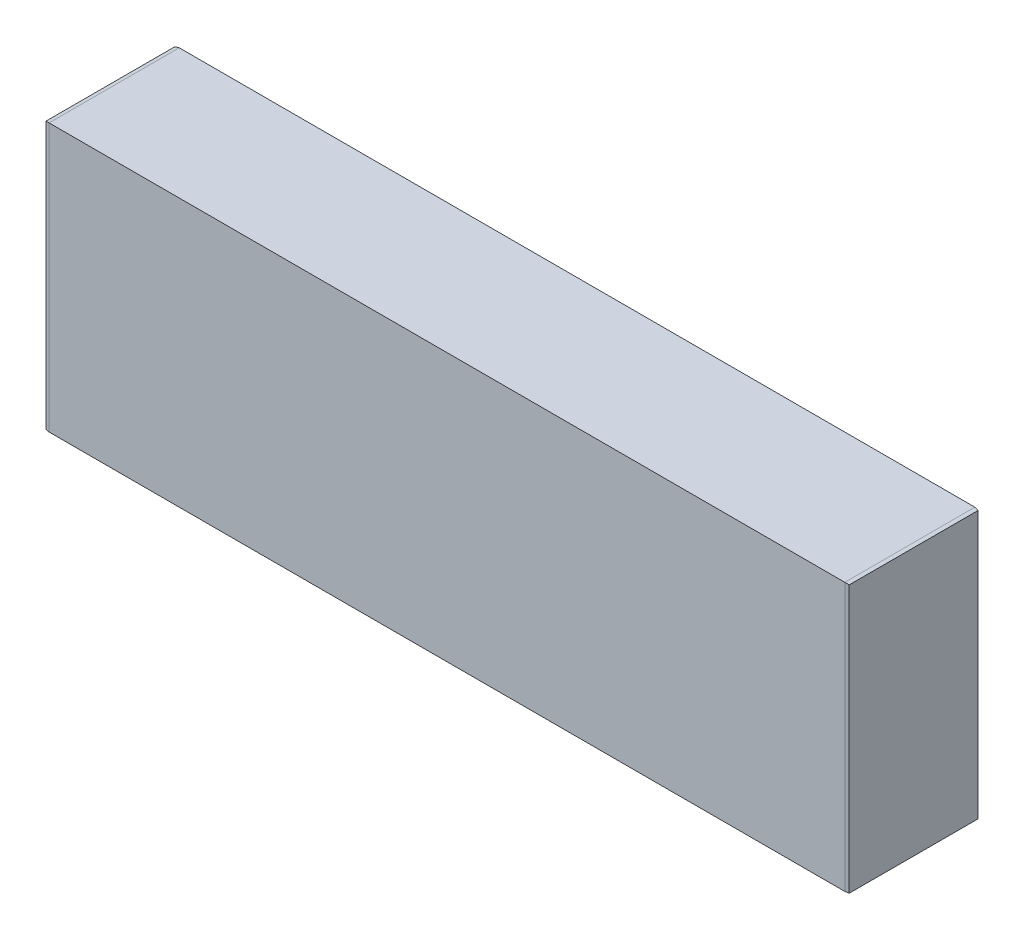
ISO-10303-21;
HEADER;
FILE_DESCRIPTION(('STEP AP214'),'2;1');
FILE_NAME('part.step','',(''),(''),'','','');
FILE_SCHEMA(('AUTOMOTIVE_DESIGN { 1 0 10303 214 1 1 1 1 }'));
ENDSEC;
DATA;
#1=APPLICATION_CONTEXT('core data for automotive mechanical design processes');
#2=APPLICATION_PROTOCOL_DEFINITION('international standard','automotive_design',2000,#1);
#3=PRODUCT_CONTEXT('',#1,'mechanical');
#4=PRODUCT('Part','Part','',(#3));
#5=PRODUCT_RELATED_PRODUCT_CATEGORY('part','',(#4));
#6=PRODUCT_DEFINITION_FORMATION('','',#4);
#7=PRODUCT_DEFINITION_CONTEXT('part definition',#1,'design');
#8=PRODUCT_DEFINITION('design','',#6,#7);
#9=PRODUCT_DEFINITION_SHAPE('','',#8);
#10=(LENGTH_UNIT() NAMED_UNIT(*) SI_UNIT(.MILLI.,.METRE.));
#11=(NAMED_UNIT(*) PLANE_ANGLE_UNIT() SI_UNIT($,.RADIAN.));
#12=(NAMED_UNIT(*) SI_UNIT($,.STERADIAN.) SOLID_ANGLE_UNIT());
#13=UNCERTAINTY_MEASURE_WITH_UNIT(LENGTH_MEASURE(1.E-05),#10,'distance_accuracy_value','');
#14=(GEOMETRIC_REPRESENTATION_CONTEXT(3) GLOBAL_UNCERTAINTY_ASSIGNED_CONTEXT((#13)) GLOBAL_UNIT_ASSIGNED_CONTEXT((#10,
#11,#12)) REPRESENTATION_CONTEXT('',''));
#15=CARTESIAN_POINT('',(0.,0.,0.));
#16=DIRECTION('',(0.,0.,1.));
#17=DIRECTION('',(1.,0.,0.));
#18=AXIS2_PLACEMENT_3D('',#15,#16,#17);
#19=CARTESIAN_POINT('',(-45.3301018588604,26.9451463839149,34.5));
#20=DIRECTION('',(1.,0.,0.));
#21=DIRECTION('',(0.,1.,0.));
#22=AXIS2_PLACEMENT_3D('',#19,#20,#21);
#23=PLANE('',#22);
#24=DIRECTION('',(0.,0.,1.));
#25=VECTOR('',#24,1.);
#26=CARTESIAN_POINT('',(-45.3301018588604,-39.3572722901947,22.7204287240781));
#27=LINE('',#26,#25);
#28=CARTESIAN_POINT('',(-45.3301018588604,-39.3572722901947,22.7204287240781));
#29=VERTEX_POINT('',#28);
#30=CARTESIAN_POINT('',(-45.3301018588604,-39.3572722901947,28.7204287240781));
#31=VERTEX_POINT('',#30);
#32=EDGE_CURVE('E345',#29,#31,#27,.T.);
#33=ORIENTED_EDGE('',*,*,#32,.F.);
#34=DIRECTION('',(0.,-1.,0.));
#35=VECTOR('',#34,1.);
#36=CARTESIAN_POINT('',(-45.3301018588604,-38.3572722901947,22.7204287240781));
#37=LINE('',#36,#35);
#38=CARTESIAN_POINT('',(-45.3301018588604,-38.3572722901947,22.7204287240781));
#39=VERTEX_POINT('',#38);
#40=EDGE_CURVE('E51',#39,#29,#37,.T.);
#41=ORIENTED_EDGE('',*,*,#40,.F.);
#42=DIRECTION('',(0.,0.,-1.));
#43=VECTOR('',#42,1.);
#44=CARTESIAN_POINT('',(-45.3301018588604,-38.3572722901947,22.7204287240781));
#45=LINE('',#44,#43);
#46=CARTESIAN_POINT('',(-45.3301018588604,-38.3572722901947,28.7204287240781));
#47=VERTEX_POINT('',#46);
#48=EDGE_CURVE('E336',#47,#39,#45,.T.);
#49=ORIENTED_EDGE('',*,*,#48,.F.);
#50=DIRECTION('',(0.,1.,0.));
#51=VECTOR('',#50,1.);
#52=CARTESIAN_POINT('',(-45.3301018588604,-38.3572722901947,28.7204287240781));
#53=LINE('',#52,#51);
#54=EDGE_CURVE('E339',#31,#47,#53,.T.);
#55=ORIENTED_EDGE('',*,*,#54,.F.);
#56=EDGE_LOOP('',(#33,#41,#49,#55));
#57=FACE_BOUND('',#56,.T.);
#58=DIRECTION('',(0.,0.,-1.));
#59=VECTOR('',#58,1.);
#60=CARTESIAN_POINT('',(-45.3301018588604,-38.3572722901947,5.67632698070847));
#61=LINE('',#60,#59);
#62=CARTESIAN_POINT('',(-45.3301018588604,-38.3572722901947,8.17632698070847));
#63=VERTEX_POINT('',#62);
#64=CARTESIAN_POINT('',(-45.3301018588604,-38.3572722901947,5.67632698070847));
#65=VERTEX_POINT('',#64);
#66=EDGE_CURVE('E393',#63,#65,#61,.T.);
#67=ORIENTED_EDGE('',*,*,#66,.F.);
#68=DIRECTION('',(0.,-1.,0.));
#69=VECTOR('',#68,1.);
#70=CARTESIAN_POINT('',(-45.3301018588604,-35.8572722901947,8.17632698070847));
#71=LINE('',#70,#69);
#72=CARTESIAN_POINT('',(-45.3301018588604,-35.8572722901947,8.17632698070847));
#73=VERTEX_POINT('',#72);
#74=EDGE_CURVE('E59',#73,#63,#71,.T.);
#75=ORIENTED_EDGE('',*,*,#74,.F.);
#76=DIRECTION('',(0.,0.,-1.));
#77=VECTOR('',#76,1.);
#78=CARTESIAN_POINT('',(-45.3301018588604,-35.8572722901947,8.17632698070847));
#79=LINE('',#78,#77);
#80=CARTESIAN_POINT('',(-45.3301018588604,-35.8572722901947,9.17632698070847));
#81=VERTEX_POINT('',#80);
#82=EDGE_CURVE('E358',#81,#73,#79,.T.);
#83=ORIENTED_EDGE('',*,*,#82,.F.);
#84=DIRECTION('',(0.,1.,0.));
#85=VECTOR('',#84,1.);
#86=CARTESIAN_POINT('',(-45.3301018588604,-35.8572722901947,9.17632698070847));
#87=LINE('',#86,#85);
#88=CARTESIAN_POINT('',(-45.3301018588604,-38.3572722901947,9.17632698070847));
#89=VERTEX_POINT('',#88);
#90=EDGE_CURVE('E420',#89,#81,#87,.T.);
#91=ORIENTED_EDGE('',*,*,#90,.F.);
#92=DIRECTION('',(0.,0.,-1.));
#93=VECTOR('',#92,1.);
#94=CARTESIAN_POINT('',(-45.3301018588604,-38.3572722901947,9.17632698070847));
#95=LINE('',#94,#93);
#96=CARTESIAN_POINT('',(-45.3301018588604,-38.3572722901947,11.6763269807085));
#97=VERTEX_POINT('',#96);
#98=EDGE_CURVE('E417',#97,#89,#95,.T.);
#99=ORIENTED_EDGE('',*,*,#98,.F.);
#100=DIRECTION('',(0.,1.,0.));
#101=VECTOR('',#100,1.);
#102=CARTESIAN_POINT('',(-45.3301018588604,-38.3572722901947,11.6763269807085));
#103=LINE('',#102,#101);
#104=CARTESIAN_POINT('',(-45.3301018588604,-39.3572722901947,11.6763269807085));
#105=VERTEX_POINT('',#104);
#106=EDGE_CURVE('E414',#105,#97,#103,.T.);
#107=ORIENTED_EDGE('',*,*,#106,.F.);
#108=DIRECTION('',(0.,0.,1.));
#109=VECTOR('',#108,1.);
#110=CARTESIAN_POINT('',(-45.3301018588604,-39.3572722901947,9.17632698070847));
#111=LINE('',#110,#109);
#112=CARTESIAN_POINT('',(-45.3301018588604,-39.3572722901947,9.17632698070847));
#113=VERTEX_POINT('',#112);
#114=EDGE_CURVE('E411',#113,#105,#111,.T.);
#115=ORIENTED_EDGE('',*,*,#114,.F.);
#116=DIRECTION('',(0.,1.,0.));
#117=VECTOR('',#116,1.);
#118=CARTESIAN_POINT('',(-45.3301018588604,-39.3572722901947,9.17632698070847));
#119=LINE('',#118,#117);
#120=CARTESIAN_POINT('',(-45.3301018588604,-41.8572722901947,9.17632698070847));
#121=VERTEX_POINT('',#120);
#122=EDGE_CURVE('E408',#121,#113,#119,.T.);
#123=ORIENTED_EDGE('',*,*,#122,.F.);
#124=DIRECTION('',(0.,0.,1.));
#125=VECTOR('',#124,1.);
#126=CARTESIAN_POINT('',(-45.3301018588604,-41.8572722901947,8.17632698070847));
#127=LINE('',#126,#125);
#128=CARTESIAN_POINT('',(-45.3301018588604,-41.8572722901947,8.17632698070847));
#129=VERTEX_POINT('',#128);
#130=EDGE_CURVE('E405',#129,#121,#127,.T.);
#131=ORIENTED_EDGE('',*,*,#130,.F.);
#132=DIRECTION('',(0.,-1.,0.));
#133=VECTOR('',#132,1.);
#134=CARTESIAN_POINT('',(-45.3301018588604,-39.3572722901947,8.17632698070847));
#135=LINE('',#134,#133);
#136=CARTESIAN_POINT('',(-45.3301018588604,-39.3572722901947,8.17632698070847));
#137=VERTEX_POINT('',#136);
#138=EDGE_CURVE('E402',#137,#129,#135,.T.);
#139=ORIENTED_EDGE('',*,*,#138,.F.);
#140=DIRECTION('',(0.,0.,1.));
#141=VECTOR('',#140,1.);
#142=CARTESIAN_POINT('',(-45.3301018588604,-39.3572722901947,5.67632698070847));
#143=LINE('',#142,#141);
#144=CARTESIAN_POINT('',(-45.3301018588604,-39.3572722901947,5.67632698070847));
#145=VERTEX_POINT('',#144);
#146=EDGE_CURVE('E399',#145,#137,#143,.T.);
#147=ORIENTED_EDGE('',*,*,#146,.F.);
#148=DIRECTION('',(0.,-1.,0.));
#149=VECTOR('',#148,1.);
#150=CARTESIAN_POINT('',(-45.3301018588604,-38.3572722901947,5.67632698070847));
#151=LINE('',#150,#149);
#152=EDGE_CURVE('E396',#65,#145,#151,.T.);
#153=ORIENTED_EDGE('',*,*,#152,.F.);
#154=EDGE_LOOP('',(#67,#75,#83,#91,#99,#107,#115,#123,#131,#139,#147,#153));
#155=FACE_BOUND('',#154,.T.);
#156=DIRECTION('',(0.,0.,1.));
#157=VECTOR('',#156,1.);
#158=CARTESIAN_POINT('',(-45.3301018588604,-33.8572722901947,5.17632698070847));
#159=LINE('',#158,#157);
#160=CARTESIAN_POINT('',(-45.3301018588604,-33.8572722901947,5.17632698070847));
#161=VERTEX_POINT('',#160);
#162=CARTESIAN_POINT('',(-45.3301018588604,-33.8572722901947,29.3236730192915));
#163=VERTEX_POINT('',#162);
#164=EDGE_CURVE('E596',#161,#163,#159,.T.);
#165=ORIENTED_EDGE('',*,*,#164,.F.);
#166=DIRECTION('',(0.,-1.,0.));
#167=VECTOR('',#166,1.);
#168=CARTESIAN_POINT('',(-45.3301018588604,-17.6597000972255,5.17632698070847));
#169=LINE('',#168,#167);
#170=CARTESIAN_POINT('',(-45.3301018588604,-17.6597000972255,5.17632698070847));
#171=VERTEX_POINT('',#170);
#172=EDGE_CURVE('E574',#171,#161,#169,.T.);
#173=ORIENTED_EDGE('',*,*,#172,.F.);
#174=DIRECTION('',(0.,0.,-1.));
#175=VECTOR('',#174,1.);
#176=CARTESIAN_POINT('',(-45.3301018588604,-17.6597000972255,5.17632698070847));
#177=LINE('',#176,#175);
#178=CARTESIAN_POINT('',(-45.3301018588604,-17.6597000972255,29.3236730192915));
#179=VERTEX_POINT('',#178);
#180=EDGE_CURVE('E585',#179,#171,#177,.T.);
#181=ORIENTED_EDGE('',*,*,#180,.F.);
#182=DIRECTION('',(0.,1.,0.));
#183=VECTOR('',#182,1.);
#184=CARTESIAN_POINT('',(-45.3301018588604,-17.6597000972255,29.3236730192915));
#185=LINE('',#184,#183);
#186=EDGE_CURVE('E599',#163,#179,#185,.T.);
#187=ORIENTED_EDGE('',*,*,#186,.F.);
#188=EDGE_LOOP('',(#165,#173,#181,#187));
#189=FACE_BOUND('',#188,.T.);
#190=DIRECTION('',(0.,0.,-1.));
#191=VECTOR('',#190,1.);
#192=CARTESIAN_POINT('',(-45.3301018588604,-44.0548536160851,34.5));
#193=LINE('',#192,#191);
#194=CARTESIAN_POINT('',(-45.3301018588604,-44.0548536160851,34.3236730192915));
#195=VERTEX_POINT('',#194);
#196=CARTESIAN_POINT('',(-45.3301018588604,-44.0548536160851,0.176326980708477));
#197=VERTEX_POINT('',#196);
#198=EDGE_CURVE('E627',#195,#197,#193,.T.);
#199=ORIENTED_EDGE('',*,*,#198,.F.);
#200=DIRECTION('',(0.,1.,0.));
#201=VECTOR('',#200,1.);
#202=CARTESIAN_POINT('',(-45.3301018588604,26.9451463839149,34.3236730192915));
#203=LINE('',#202,#201);
#204=CARTESIAN_POINT('',(-45.3301018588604,26.7688194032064,34.3236730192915));
#205=VERTEX_POINT('',#204);
#206=EDGE_CURVE('E641',#195,#205,#203,.T.);
#207=ORIENTED_EDGE('',*,*,#206,.T.);
#208=DIRECTION('',(0.,0.,-1.));
#209=VECTOR('',#208,1.);
#210=CARTESIAN_POINT('',(-45.3301018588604,26.7688194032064,34.5));
#211=LINE('',#210,#209);
#212=CARTESIAN_POINT('',(-45.3301018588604,26.7688194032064,0.17632698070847));
#213=VERTEX_POINT('',#212);
#214=EDGE_CURVE('E637',#205,#213,#211,.T.);
#215=ORIENTED_EDGE('',*,*,#214,.T.);
#216=DIRECTION('',(0.,-1.,0.));
#217=VECTOR('',#216,1.);
#218=CARTESIAN_POINT('',(-45.3301018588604,26.9451463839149,0.17632698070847));
#219=LINE('',#218,#217);
#220=EDGE_CURVE('E639',#213,#197,#219,.T.);
#221=ORIENTED_EDGE('',*,*,#220,.T.);
#222=EDGE_LOOP('',(#199,#207,#215,#221));
#223=FACE_BOUND('',#222,.T.);
#224=ADVANCED_FACE('F34',(#57,#155,#189,#223),#23,.F.);
#225=CARTESIAN_POINT('',(-45.3301018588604,-44.0548536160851,34.5));
#226=DIRECTION('',(0.,1.,0.));
#227=DIRECTION('',(0.,0.,1.));
#228=AXIS2_PLACEMENT_3D('',#225,#226,#227);
#229=PLANE('',#228);
#230=DIRECTION('',(1.,0.,0.));
#231=VECTOR('',#230,1.);
#232=CARTESIAN_POINT('',(-45.3301018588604,-44.0548536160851,0.));
#233=LINE('',#232,#231);
#234=CARTESIAN_POINT('',(-44.3301018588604,-44.0548536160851,0.));
#235=VERTEX_POINT('',#234);
#236=CARTESIAN_POINT('',(166.669898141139,-44.0548536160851,0.));
#237=VERTEX_POINT('',#236);
#238=EDGE_CURVE('E620',#235,#237,#233,.T.);
#239=ORIENTED_EDGE('',*,*,#238,.T.);
#240=DIRECTION('',(-0.984807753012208,0.,-0.173648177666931));
#241=VECTOR('',#240,1.);
#242=CARTESIAN_POINT('',(167.66989814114,-44.0548536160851,0.17632698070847));
#243=LINE('',#242,#241);
#244=CARTESIAN_POINT('',(167.66989814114,-44.0548536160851,0.176326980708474));
#245=VERTEX_POINT('',#244);
#246=EDGE_CURVE('E665',#237,#245,#243,.F.);
#247=ORIENTED_EDGE('',*,*,#246,.T.);
#248=DIRECTION('',(0.,0.,-1.));
#249=VECTOR('',#248,1.);
#250=CARTESIAN_POINT('',(167.66989814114,-44.0548536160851,34.5));
#251=LINE('',#250,#249);
#252=CARTESIAN_POINT('',(167.66989814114,-44.0548536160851,34.3236730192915));
#253=VERTEX_POINT('',#252);
#254=EDGE_CURVE('E619',#253,#245,#251,.T.);
#255=ORIENTED_EDGE('',*,*,#254,.F.);
#256=DIRECTION('',(-0.984807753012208,0.,0.173648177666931));
#257=VECTOR('',#256,1.);
#258=CARTESIAN_POINT('',(166.66989814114,-44.0548536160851,34.5));
#259=LINE('',#258,#257);
#260=CARTESIAN_POINT('',(166.669898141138,-44.0548536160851,34.5000000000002));
#261=VERTEX_POINT('',#260);
#262=EDGE_CURVE('E663',#253,#261,#259,.T.);
#263=ORIENTED_EDGE('',*,*,#262,.T.);
#264=DIRECTION('',(1.,0.,0.));
#265=VECTOR('',#264,1.);
#266=CARTESIAN_POINT('',(-45.3301018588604,-44.0548536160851,34.5));
#267=LINE('',#266,#265);
#268=CARTESIAN_POINT('',(-44.3301018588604,-44.0548536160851,34.5));
#269=VERTEX_POINT('',#268);
#270=EDGE_CURVE('E613',#269,#261,#267,.T.);
#271=ORIENTED_EDGE('',*,*,#270,.F.);
#272=DIRECTION('',(-0.984807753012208,0.,-0.173648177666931));
#273=VECTOR('',#272,1.);
#274=CARTESIAN_POINT('',(-44.3301018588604,-44.0548536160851,34.5));
#275=LINE('',#274,#273);
#276=EDGE_CURVE('E635',#269,#195,#275,.T.);
#277=ORIENTED_EDGE('',*,*,#276,.T.);
#278=ORIENTED_EDGE('',*,*,#198,.T.);
#279=DIRECTION('',(-0.984807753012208,0.,0.173648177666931));
#280=VECTOR('',#279,1.);
#281=CARTESIAN_POINT('',(-45.3301018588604,-44.0548536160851,0.176326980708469));
#282=LINE('',#281,#280);
#283=EDGE_CURVE('E633',#197,#235,#282,.F.);
#284=ORIENTED_EDGE('',*,*,#283,.T.);
#285=EDGE_LOOP('',(#239,#247,#255,#263,#271,#277,#278,#284));
#286=FACE_BOUND('',#285,.T.);
#287=ADVANCED_FACE('F685',(#286),#229,.F.);
#288=CARTESIAN_POINT('',(167.66989814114,26.9451463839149,34.5));
#289=DIRECTION('',(-1.,0.,0.));
#290=DIRECTION('',(0.,0.,1.));
#291=AXIS2_PLACEMENT_3D('',#288,#289,#290);
#292=PLANE('',#291);
#293=ORIENTED_EDGE('',*,*,#254,.T.);
#294=DIRECTION('',(0.,1.,0.));
#295=VECTOR('',#294,1.);
#296=CARTESIAN_POINT('',(167.66989814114,26.9451463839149,0.17632698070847));
#297=LINE('',#296,#295);
#298=CARTESIAN_POINT('',(167.66989814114,26.7688194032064,0.17632698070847));
#299=VERTEX_POINT('',#298);
#300=EDGE_CURVE('E658',#245,#299,#297,.T.);
#301=ORIENTED_EDGE('',*,*,#300,.T.);
#302=DIRECTION('',(0.,0.,1.));
#303=VECTOR('',#302,1.);
#304=CARTESIAN_POINT('',(167.66989814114,26.7688194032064,34.5));
#305=LINE('',#304,#303);
#306=CARTESIAN_POINT('',(167.66989814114,26.7688194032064,34.3236730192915));
#307=VERTEX_POINT('',#306);
#308=EDGE_CURVE('E649',#299,#307,#305,.T.);
#309=ORIENTED_EDGE('',*,*,#308,.T.);
#310=DIRECTION('',(0.,-1.,0.));
#311=VECTOR('',#310,1.);
#312=CARTESIAN_POINT('',(167.66989814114,-44.0548536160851,34.3236730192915));
#313=LINE('',#312,#311);
#314=EDGE_CURVE('E656',#307,#253,#313,.T.);
#315=ORIENTED_EDGE('',*,*,#314,.T.);
#316=EDGE_LOOP('',(#293,#301,#309,#315));
#317=FACE_BOUND('',#316,.T.);
#318=ADVANCED_FACE('F683',(#317),#292,.F.);
#319=CARTESIAN_POINT('',(-45.3301018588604,26.9451463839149,34.5));
#320=DIRECTION('',(0.,-1.,0.));
#321=DIRECTION('',(0.,0.,-1.));
#322=AXIS2_PLACEMENT_3D('',#319,#320,#321);
#323=PLANE('',#322);
#324=DIRECTION('',(-1.,0.,0.));
#325=VECTOR('',#324,1.);
#326=CARTESIAN_POINT('',(-45.3301018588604,26.9451463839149,34.5));
#327=LINE('',#326,#325);
#328=CARTESIAN_POINT('',(166.66989814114,26.9451463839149,34.5));
#329=VERTEX_POINT('',#328);
#330=CARTESIAN_POINT('',(-44.3301018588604,26.9451463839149,34.5));
#331=VERTEX_POINT('',#330);
#332=EDGE_CURVE('E616',#329,#331,#327,.T.);
#333=ORIENTED_EDGE('',*,*,#332,.F.);
#334=DIRECTION('',(0.,0.,-1.));
#335=VECTOR('',#334,1.);
#336=CARTESIAN_POINT('',(166.66989814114,26.9451463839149,34.5));
#337=LINE('',#336,#335);
#338=CARTESIAN_POINT('',(166.66989814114,26.9451463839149,0.));
#339=VERTEX_POINT('',#338);
#340=EDGE_CURVE('E11',#329,#339,#337,.T.);
#341=ORIENTED_EDGE('',*,*,#340,.T.);
#342=DIRECTION('',(-1.,0.,0.));
#343=VECTOR('',#342,1.);
#344=CARTESIAN_POINT('',(-45.3301018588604,26.9451463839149,0.));
#345=LINE('',#344,#343);
#346=CARTESIAN_POINT('',(-44.3301018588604,26.9451463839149,0.));
#347=VERTEX_POINT('',#346);
#348=EDGE_CURVE('E617',#339,#347,#345,.T.);
#349=ORIENTED_EDGE('',*,*,#348,.T.);
#350=DIRECTION('',(0.,0.,1.));
#351=VECTOR('',#350,1.);
#352=CARTESIAN_POINT('',(-44.3301018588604,26.9451463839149,34.5));
#353=LINE('',#352,#351);
#354=EDGE_CURVE('E646',#347,#331,#353,.T.);
#355=ORIENTED_EDGE('',*,*,#354,.T.);
#356=EDGE_LOOP('',(#333,#341,#349,#355));
#357=FACE_BOUND('',#356,.T.);
#358=ADVANCED_FACE('F697',(#357),#323,.F.);
#359=CARTESIAN_POINT('',(-45.3301018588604,-44.0548536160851,34.5));
#360=DIRECTION('',(0.,0.,1.));
#361=DIRECTION('',(1.,0.,0.));
#362=AXIS2_PLACEMENT_3D('',#359,#360,#361);
#363=PLANE('',#362);
#364=ORIENTED_EDGE('',*,*,#270,.T.);
#365=DIRECTION('',(0.,1.,0.));
#366=VECTOR('',#365,1.);
#367=CARTESIAN_POINT('',(166.66989814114,26.9451463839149,34.5));
#368=LINE('',#367,#366);
#369=EDGE_CURVE('E43',#261,#329,#368,.T.);
#370=ORIENTED_EDGE('',*,*,#369,.T.);
#371=ORIENTED_EDGE('',*,*,#332,.T.);
#372=DIRECTION('',(0.,-1.,0.));
#373=VECTOR('',#372,1.);
#374=CARTESIAN_POINT('',(-44.3301018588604,-44.0548536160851,34.5));
#375=LINE('',#374,#373);
#376=EDGE_CURVE('E630',#331,#269,#375,.T.);
#377=ORIENTED_EDGE('',*,*,#376,.T.);
#378=EDGE_LOOP('',(#364,#370,#371,#377));
#379=FACE_BOUND('',#378,.T.);
#380=ADVANCED_FACE('F701',(#379),#363,.T.);
#381=CARTESIAN_POINT('',(-45.3301018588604,-44.0548536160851,0.));
#382=DIRECTION('',(0.,0.,1.));
#383=DIRECTION('',(1.,0.,0.));
#384=AXIS2_PLACEMENT_3D('',#381,#382,#383);
#385=PLANE('',#384);
#386=ORIENTED_EDGE('',*,*,#348,.F.);
#387=DIRECTION('',(0.,-1.,0.));
#388=VECTOR('',#387,1.);
#389=CARTESIAN_POINT('',(166.66989814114,-44.0548536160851,0.));
#390=LINE('',#389,#388);
#391=EDGE_CURVE('E661',#339,#237,#390,.T.);
#392=ORIENTED_EDGE('',*,*,#391,.T.);
#393=ORIENTED_EDGE('',*,*,#238,.F.);
#394=DIRECTION('',(0.,1.,0.));
#395=VECTOR('',#394,1.);
#396=CARTESIAN_POINT('',(-44.3301018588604,-44.0548536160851,0.));
#397=LINE('',#396,#395);
#398=EDGE_CURVE('E643',#235,#347,#397,.T.);
#399=ORIENTED_EDGE('',*,*,#398,.T.);
#400=EDGE_LOOP('',(#386,#392,#393,#399));
#401=FACE_BOUND('',#400,.T.);
#402=ADVANCED_FACE('F692',(#401),#385,.F.);
#403=CARTESIAN_POINT('',(-45.3301018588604,26.9451463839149,0.17632698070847));
#404=DIRECTION('',(0.173648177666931,0.,0.984807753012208));
#405=DIRECTION('',(0.984807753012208,0.,-0.173648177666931));
#406=AXIS2_PLACEMENT_3D('',#403,#404,#405);
#407=PLANE('',#406);
#408=ORIENTED_EDGE('',*,*,#283,.F.);
#409=ORIENTED_EDGE('',*,*,#220,.F.);
#410=DIRECTION('',(-0.970287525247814,-0.171087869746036,0.171087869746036));
#411=VECTOR('',#410,1.);
#412=CARTESIAN_POINT('',(-51.0279834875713,25.7641291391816,1.1810172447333));
#413=LINE('',#412,#411);
#414=EDGE_CURVE('E623',#347,#213,#413,.T.);
#415=ORIENTED_EDGE('',*,*,#414,.F.);
#416=ORIENTED_EDGE('',*,*,#398,.F.);
#417=EDGE_LOOP('',(#408,#409,#415,#416));
#418=FACE_BOUND('',#417,.T.);
#419=ADVANCED_FACE('F714',(#418),#407,.F.);
#420=CARTESIAN_POINT('',(-45.3301018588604,26.7688194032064,34.5));
#421=DIRECTION('',(0.173648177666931,-0.984807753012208,0.));
#422=DIRECTION('',(0.984807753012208,0.173648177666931,0.));
#423=AXIS2_PLACEMENT_3D('',#420,#421,#422);
#424=PLANE('',#423);
#425=ORIENTED_EDGE('',*,*,#414,.T.);
#426=ORIENTED_EDGE('',*,*,#214,.F.);
#427=DIRECTION('',(-0.970287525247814,-0.171087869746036,-0.171087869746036));
#428=VECTOR('',#427,1.);
#429=CARTESIAN_POINT('',(-45.3008307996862,26.7739806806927,34.3288342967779));
#430=LINE('',#429,#428);
#431=EDGE_CURVE('E650',#331,#205,#430,.T.);
#432=ORIENTED_EDGE('',*,*,#431,.F.);
#433=ORIENTED_EDGE('',*,*,#354,.F.);
#434=EDGE_LOOP('',(#425,#426,#432,#433));
#435=FACE_BOUND('',#434,.T.);
#436=ADVANCED_FACE('F712',(#435),#424,.F.);
#437=CARTESIAN_POINT('',(-44.3301018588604,-44.0548536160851,34.5));
#438=DIRECTION('',(-0.173648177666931,0.,0.984807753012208));
#439=DIRECTION('',(0.984807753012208,0.,0.173648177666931));
#440=AXIS2_PLACEMENT_3D('',#437,#438,#439);
#441=PLANE('',#440);
#442=ORIENTED_EDGE('',*,*,#431,.T.);
#443=ORIENTED_EDGE('',*,*,#206,.F.);
#444=ORIENTED_EDGE('',*,*,#276,.F.);
#445=ORIENTED_EDGE('',*,*,#376,.F.);
#446=EDGE_LOOP('',(#442,#443,#444,#445));
#447=FACE_BOUND('',#446,.T.);
#448=ADVANCED_FACE('F710',(#447),#441,.T.);
#449=CARTESIAN_POINT('',(166.66989814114,-44.0548536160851,34.5));
#450=DIRECTION('',(0.173648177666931,0.,0.984807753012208));
#451=DIRECTION('',(0.984807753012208,0.,-0.173648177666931));
#452=AXIS2_PLACEMENT_3D('',#449,#450,#451);
#453=PLANE('',#452);
#454=ORIENTED_EDGE('',*,*,#262,.F.);
#455=ORIENTED_EDGE('',*,*,#314,.F.);
#456=DIRECTION('',(-0.970287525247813,0.17108786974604,0.171087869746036));
#457=VECTOR('',#456,1.);
#458=CARTESIAN_POINT('',(166.66989814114,26.9451463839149,34.5));
#459=LINE('',#458,#457);
#460=EDGE_CURVE('E38',#329,#307,#459,.F.);
#461=ORIENTED_EDGE('',*,*,#460,.F.);
#462=ORIENTED_EDGE('',*,*,#369,.F.);
#463=EDGE_LOOP('',(#454,#455,#461,#462));
#464=FACE_BOUND('',#463,.T.);
#465=ADVANCED_FACE('F36',(#464),#453,.T.);
#466=CARTESIAN_POINT('',(166.66989814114,26.9451463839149,34.5));
#467=DIRECTION('',(-0.173648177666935,-0.984807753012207,0.));
#468=DIRECTION('',(0.984807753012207,-0.173648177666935,0.));
#469=AXIS2_PLACEMENT_3D('',#466,#467,#468);
#470=PLANE('',#469);
#471=ORIENTED_EDGE('',*,*,#460,.T.);
#472=ORIENTED_EDGE('',*,*,#308,.F.);
#473=DIRECTION('',(-0.970287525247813,0.17108786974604,-0.171087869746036));
#474=VECTOR('',#473,1.);
#475=CARTESIAN_POINT('',(172.397050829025,25.9352948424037,1.00985154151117));
#476=LINE('',#475,#474);
#477=EDGE_CURVE('E606',#339,#299,#476,.F.);
#478=ORIENTED_EDGE('',*,*,#477,.F.);
#479=ORIENTED_EDGE('',*,*,#340,.F.);
#480=EDGE_LOOP('',(#471,#472,#478,#479));
#481=FACE_BOUND('',#480,.T.);
#482=ADVANCED_FACE('F676',(#481),#470,.F.);
#483=CARTESIAN_POINT('',(167.66989814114,26.9451463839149,0.17632698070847));
#484=DIRECTION('',(-0.173648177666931,0.,0.984807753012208));
#485=DIRECTION('',(0.984807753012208,0.,0.173648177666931));
#486=AXIS2_PLACEMENT_3D('',#483,#484,#485);
#487=PLANE('',#486);
#488=ORIENTED_EDGE('',*,*,#246,.F.);
#489=ORIENTED_EDGE('',*,*,#391,.F.);
#490=ORIENTED_EDGE('',*,*,#477,.T.);
#491=ORIENTED_EDGE('',*,*,#300,.F.);
#492=EDGE_LOOP('',(#488,#489,#490,#491));
#493=FACE_BOUND('',#492,.T.);
#494=ADVANCED_FACE('F689',(#493),#487,.F.);
#495=CARTESIAN_POINT('',(-44.3301018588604,-17.6597000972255,5.17632698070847));
#496=DIRECTION('',(0.,0.,-1.));
#497=DIRECTION('',(-1.,0.,0.));
#498=AXIS2_PLACEMENT_3D('',#495,#496,#497);
#499=PLANE('',#498);
#500=ORIENTED_EDGE('',*,*,#172,.T.);
#501=DIRECTION('',(-1.,0.,0.));
#502=VECTOR('',#501,1.);
#503=CARTESIAN_POINT('',(-44.3301018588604,-33.8572722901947,5.17632698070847));
#504=LINE('',#503,#502);
#505=CARTESIAN_POINT('',(-44.3301018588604,-33.8572722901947,5.17632698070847));
#506=VERTEX_POINT('',#505);
#507=EDGE_CURVE('E594',#506,#161,#504,.T.);
#508=ORIENTED_EDGE('',*,*,#507,.F.);
#509=DIRECTION('',(0.,-1.,0.));
#510=VECTOR('',#509,1.);
#511=CARTESIAN_POINT('',(-44.3301018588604,-17.6597000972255,5.17632698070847));
#512=LINE('',#511,#510);
#513=CARTESIAN_POINT('',(-44.3301018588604,-17.6597000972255,5.17632698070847));
#514=VERTEX_POINT('',#513);
#515=EDGE_CURVE('E581',#514,#506,#512,.T.);
#516=ORIENTED_EDGE('',*,*,#515,.F.);
#517=DIRECTION('',(-1.,0.,0.));
#518=VECTOR('',#517,1.);
#519=CARTESIAN_POINT('',(-44.3301018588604,-17.6597000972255,5.17632698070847));
#520=LINE('',#519,#518);
#521=EDGE_CURVE('E604',#514,#171,#520,.T.);
#522=ORIENTED_EDGE('',*,*,#521,.T.);
#523=EDGE_LOOP('',(#500,#508,#516,#522));
#524=FACE_BOUND('',#523,.T.);
#525=ADVANCED_FACE('F791',(#524),#499,.F.);
#526=CARTESIAN_POINT('',(-44.3301018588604,-17.6597000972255,5.17632698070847));
#527=DIRECTION('',(0.,1.,0.));
#528=DIRECTION('',(-1.,0.,0.));
#529=AXIS2_PLACEMENT_3D('',#526,#527,#528);
#530=PLANE('',#529);
#531=ORIENTED_EDGE('',*,*,#180,.T.);
#532=ORIENTED_EDGE('',*,*,#521,.F.);
#533=DIRECTION('',(0.,0.,-1.));
#534=VECTOR('',#533,1.);
#535=CARTESIAN_POINT('',(-44.3301018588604,-17.6597000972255,5.17632698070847));
#536=LINE('',#535,#534);
#537=CARTESIAN_POINT('',(-44.3301018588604,-17.6597000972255,29.3236730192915));
#538=VERTEX_POINT('',#537);
#539=EDGE_CURVE('E591',#538,#514,#536,.T.);
#540=ORIENTED_EDGE('',*,*,#539,.F.);
#541=DIRECTION('',(-1.,0.,0.));
#542=VECTOR('',#541,1.);
#543=CARTESIAN_POINT('',(-44.3301018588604,-17.6597000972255,29.3236730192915));
#544=LINE('',#543,#542);
#545=EDGE_CURVE('E607',#538,#179,#544,.T.);
#546=ORIENTED_EDGE('',*,*,#545,.T.);
#547=EDGE_LOOP('',(#531,#532,#540,#546));
#548=FACE_BOUND('',#547,.T.);
#549=ADVANCED_FACE('F800',(#548),#530,.F.);
#550=CARTESIAN_POINT('',(-44.3301018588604,-17.6597000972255,29.3236730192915));
#551=DIRECTION('',(0.,0.,1.));
#552=DIRECTION('',(0.,-1.,0.));
#553=AXIS2_PLACEMENT_3D('',#550,#551,#552);
#554=PLANE('',#553);
#555=ORIENTED_EDGE('',*,*,#186,.T.);
#556=ORIENTED_EDGE('',*,*,#545,.F.);
#557=DIRECTION('',(0.,1.,0.));
#558=VECTOR('',#557,1.);
#559=CARTESIAN_POINT('',(-44.3301018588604,-17.6597000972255,29.3236730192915));
#560=LINE('',#559,#558);
#561=CARTESIAN_POINT('',(-44.3301018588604,-33.8572722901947,29.3236730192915));
#562=VERTEX_POINT('',#561);
#563=EDGE_CURVE('E588',#562,#538,#560,.T.);
#564=ORIENTED_EDGE('',*,*,#563,.F.);
#565=DIRECTION('',(-1.,0.,0.));
#566=VECTOR('',#565,1.);
#567=CARTESIAN_POINT('',(-44.3301018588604,-33.8572722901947,29.3236730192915));
#568=LINE('',#567,#566);
#569=EDGE_CURVE('E609',#562,#163,#568,.T.);
#570=ORIENTED_EDGE('',*,*,#569,.T.);
#571=EDGE_LOOP('',(#555,#556,#564,#570));
#572=FACE_BOUND('',#571,.T.);
#573=ADVANCED_FACE('F798',(#572),#554,.F.);
#574=CARTESIAN_POINT('',(-44.3301018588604,-33.8572722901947,5.17632698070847));
#575=DIRECTION('',(0.,-1.,0.));
#576=DIRECTION('',(1.,0.,0.));
#577=AXIS2_PLACEMENT_3D('',#574,#575,#576);
#578=PLANE('',#577);
#579=ORIENTED_EDGE('',*,*,#164,.T.);
#580=ORIENTED_EDGE('',*,*,#569,.F.);
#581=DIRECTION('',(0.,0.,1.));
#582=VECTOR('',#581,1.);
#583=CARTESIAN_POINT('',(-44.3301018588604,-33.8572722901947,5.17632698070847));
#584=LINE('',#583,#582);
#585=EDGE_CURVE('E584',#506,#562,#584,.T.);
#586=ORIENTED_EDGE('',*,*,#585,.F.);
#587=ORIENTED_EDGE('',*,*,#507,.T.);
#588=EDGE_LOOP('',(#579,#580,#586,#587));
#589=FACE_BOUND('',#588,.T.);
#590=ADVANCED_FACE('F778',(#589),#578,.F.);
#591=CARTESIAN_POINT('',(-44.3301018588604,-33.8572722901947,5.17632698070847));
#592=DIRECTION('',(-1.,0.,0.));
#593=DIRECTION('',(0.,0.,1.));
#594=AXIS2_PLACEMENT_3D('',#591,#592,#593);
#595=PLANE('',#594);
#596=DIRECTION('',(0.,0.,-1.));
#597=VECTOR('',#596,1.);
#598=CARTESIAN_POINT('',(-44.3301018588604,-19.1687906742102,23.6942038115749));
#599=LINE('',#598,#597);
#600=CARTESIAN_POINT('',(-44.3301018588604,-19.1687906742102,27.6942038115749));
#601=VERTEX_POINT('',#600);
#602=CARTESIAN_POINT('',(-44.3301018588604,-19.1687906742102,23.6942038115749));
#603=VERTEX_POINT('',#602);
#604=EDGE_CURVE('E459',#601,#603,#599,.T.);
#605=ORIENTED_EDGE('',*,*,#604,.F.);
#606=DIRECTION('',(0.,1.,0.));
#607=VECTOR('',#606,1.);
#608=CARTESIAN_POINT('',(-44.3301018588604,-19.1687906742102,27.6942038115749));
#609=LINE('',#608,#607);
#610=CARTESIAN_POINT('',(-44.3301018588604,-32.5493937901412,27.6942038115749));
#611=VERTEX_POINT('',#610);
#612=EDGE_CURVE('E456',#611,#601,#609,.T.);
#613=ORIENTED_EDGE('',*,*,#612,.F.);
#614=DIRECTION('',(0.,0.,1.));
#615=VECTOR('',#614,1.);
#616=CARTESIAN_POINT('',(-44.3301018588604,-32.5493937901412,23.6942038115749));
#617=LINE('',#616,#615);
#618=CARTESIAN_POINT('',(-44.3301018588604,-32.5493937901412,23.6942038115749));
#619=VERTEX_POINT('',#618);
#620=EDGE_CURVE('E452',#619,#611,#617,.T.);
#621=ORIENTED_EDGE('',*,*,#620,.F.);
#622=DIRECTION('',(0.,-1.,0.));
#623=VECTOR('',#622,1.);
#624=CARTESIAN_POINT('',(-44.3301018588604,-19.1687906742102,23.6942038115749));
#625=LINE('',#624,#623);
#626=EDGE_CURVE('E449',#603,#619,#625,.T.);
#627=ORIENTED_EDGE('',*,*,#626,.F.);
#628=EDGE_LOOP('',(#605,#613,#621,#627));
#629=FACE_BOUND('',#628,.T.);
#630=DIRECTION('',(0.,0.,-1.));
#631=VECTOR('',#630,1.);
#632=CARTESIAN_POINT('',(-44.3301018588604,-19.1687906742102,18.0647346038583));
#633=LINE('',#632,#631);
#634=CARTESIAN_POINT('',(-44.3301018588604,-19.1687906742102,22.0647346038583));
#635=VERTEX_POINT('',#634);
#636=CARTESIAN_POINT('',(-44.3301018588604,-19.1687906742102,18.0647346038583));
#637=VERTEX_POINT('',#636);
#638=EDGE_CURVE('E492',#635,#637,#633,.T.);
#639=ORIENTED_EDGE('',*,*,#638,.F.);
#640=DIRECTION('',(0.,1.,0.));
#641=VECTOR('',#640,1.);
#642=CARTESIAN_POINT('',(-44.3301018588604,-19.1687906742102,22.0647346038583));
#643=LINE('',#642,#641);
#644=CARTESIAN_POINT('',(-44.3301018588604,-32.5493937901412,22.0647346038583));
#645=VERTEX_POINT('',#644);
#646=EDGE_CURVE('E489',#645,#635,#643,.T.);
#647=ORIENTED_EDGE('',*,*,#646,.F.);
#648=DIRECTION('',(0.,0.,1.));
#649=VECTOR('',#648,1.);
#650=CARTESIAN_POINT('',(-44.3301018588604,-32.5493937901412,18.0647346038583));
#651=LINE('',#650,#649);
#652=CARTESIAN_POINT('',(-44.3301018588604,-32.5493937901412,18.0647346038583));
#653=VERTEX_POINT('',#652);
#654=EDGE_CURVE('E485',#653,#645,#651,.T.);
#655=ORIENTED_EDGE('',*,*,#654,.F.);
#656=DIRECTION('',(0.,-1.,0.));
#657=VECTOR('',#656,1.);
#658=CARTESIAN_POINT('',(-44.3301018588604,-19.1687906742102,18.0647346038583));
#659=LINE('',#658,#657);
#660=EDGE_CURVE('E482',#637,#653,#659,.T.);
#661=ORIENTED_EDGE('',*,*,#660,.F.);
#662=EDGE_LOOP('',(#639,#647,#655,#661));
#663=FACE_BOUND('',#662,.T.);
#664=DIRECTION('',(0.,0.,-1.));
#665=VECTOR('',#664,1.);
#666=CARTESIAN_POINT('',(-44.3301018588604,-19.1687906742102,12.4352653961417));
#667=LINE('',#666,#665);
#668=CARTESIAN_POINT('',(-44.3301018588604,-19.1687906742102,16.4352653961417));
#669=VERTEX_POINT('',#668);
#670=CARTESIAN_POINT('',(-44.3301018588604,-19.1687906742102,12.4352653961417));
#671=VERTEX_POINT('',#670);
#672=EDGE_CURVE('E525',#669,#671,#667,.T.);
#673=ORIENTED_EDGE('',*,*,#672,.F.);
#674=DIRECTION('',(0.,1.,0.));
#675=VECTOR('',#674,1.);
#676=CARTESIAN_POINT('',(-44.3301018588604,-19.1687906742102,16.4352653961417));
#677=LINE('',#676,#675);
#678=CARTESIAN_POINT('',(-44.3301018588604,-32.5493937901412,16.4352653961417));
#679=VERTEX_POINT('',#678);
#680=EDGE_CURVE('E522',#679,#669,#677,.T.);
#681=ORIENTED_EDGE('',*,*,#680,.F.);
#682=DIRECTION('',(0.,0.,1.));
#683=VECTOR('',#682,1.);
#684=CARTESIAN_POINT('',(-44.3301018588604,-32.5493937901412,12.4352653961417));
#685=LINE('',#684,#683);
#686=CARTESIAN_POINT('',(-44.3301018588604,-32.5493937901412,12.4352653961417));
#687=VERTEX_POINT('',#686);
#688=EDGE_CURVE('E518',#687,#679,#685,.T.);
#689=ORIENTED_EDGE('',*,*,#688,.F.);
#690=DIRECTION('',(0.,-1.,0.));
#691=VECTOR('',#690,1.);
#692=CARTESIAN_POINT('',(-44.3301018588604,-19.1687906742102,12.4352653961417));
#693=LINE('',#692,#691);
#694=EDGE_CURVE('E515',#671,#687,#693,.T.);
#695=ORIENTED_EDGE('',*,*,#694,.F.);
#696=EDGE_LOOP('',(#673,#681,#689,#695));
#697=FACE_BOUND('',#696,.T.);
#698=DIRECTION('',(0.,0.,-1.));
#699=VECTOR('',#698,1.);
#700=CARTESIAN_POINT('',(-44.3301018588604,-19.1687906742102,6.80579618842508));
#701=LINE('',#700,#699);
#702=CARTESIAN_POINT('',(-44.3301018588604,-19.1687906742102,10.8057961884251));
#703=VERTEX_POINT('',#702);
#704=CARTESIAN_POINT('',(-44.3301018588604,-19.1687906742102,6.80579618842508));
#705=VERTEX_POINT('',#704);
#706=EDGE_CURVE('E558',#703,#705,#701,.T.);
#707=ORIENTED_EDGE('',*,*,#706,.F.);
#708=DIRECTION('',(0.,1.,0.));
#709=VECTOR('',#708,1.);
#710=CARTESIAN_POINT('',(-44.3301018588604,-19.1687906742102,10.8057961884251));
#711=LINE('',#710,#709);
#712=CARTESIAN_POINT('',(-44.3301018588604,-32.5493937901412,10.8057961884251));
#713=VERTEX_POINT('',#712);
#714=EDGE_CURVE('E555',#713,#703,#711,.T.);
#715=ORIENTED_EDGE('',*,*,#714,.F.);
#716=DIRECTION('',(0.,0.,1.));
#717=VECTOR('',#716,1.);
#718=CARTESIAN_POINT('',(-44.3301018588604,-32.5493937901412,6.80579618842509));
#719=LINE('',#718,#717);
#720=CARTESIAN_POINT('',(-44.3301018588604,-32.5493937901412,6.80579618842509));
#721=VERTEX_POINT('',#720);
#722=EDGE_CURVE('E551',#721,#713,#719,.T.);
#723=ORIENTED_EDGE('',*,*,#722,.F.);
#724=DIRECTION('',(0.,-1.,0.));
#725=VECTOR('',#724,1.);
#726=CARTESIAN_POINT('',(-44.3301018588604,-19.1687906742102,6.80579618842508));
#727=LINE('',#726,#725);
#728=EDGE_CURVE('E548',#705,#721,#727,.T.);
#729=ORIENTED_EDGE('',*,*,#728,.F.);
#730=EDGE_LOOP('',(#707,#715,#723,#729));
#731=FACE_BOUND('',#730,.T.);
#732=ORIENTED_EDGE('',*,*,#515,.T.);
#733=ORIENTED_EDGE('',*,*,#585,.T.);
#734=ORIENTED_EDGE('',*,*,#563,.T.);
#735=ORIENTED_EDGE('',*,*,#539,.T.);
#736=EDGE_LOOP('',(#732,#733,#734,#735));
#737=FACE_BOUND('',#736,.T.);
#738=ADVANCED_FACE('F774',(#629,#663,#697,#731,#737),#595,.T.);
#739=CARTESIAN_POINT('',(-44.3301018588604,-19.1687906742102,6.80579618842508));
#740=DIRECTION('',(0.,0.,-1.));
#741=DIRECTION('',(0.,1.,0.));
#742=AXIS2_PLACEMENT_3D('',#739,#740,#741);
#743=PLANE('',#742);
#744=DIRECTION('',(0.,-1.,0.));
#745=VECTOR('',#744,1.);
#746=CARTESIAN_POINT('',(-45.3301018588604,-19.1687906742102,6.80579618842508));
#747=LINE('',#746,#745);
#748=CARTESIAN_POINT('',(-45.3301018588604,-19.1687906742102,6.80579618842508));
#749=VERTEX_POINT('',#748);
#750=CARTESIAN_POINT('',(-45.3301018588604,-32.5493937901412,6.80579618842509));
#751=VERTEX_POINT('',#750);
#752=EDGE_CURVE('E541',#749,#751,#747,.T.);
#753=ORIENTED_EDGE('',*,*,#752,.F.);
#754=DIRECTION('',(-1.,0.,0.));
#755=VECTOR('',#754,1.);
#756=CARTESIAN_POINT('',(-44.3301018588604,-19.1687906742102,6.80579618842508));
#757=LINE('',#756,#755);
#758=EDGE_CURVE('E572',#705,#749,#757,.T.);
#759=ORIENTED_EDGE('',*,*,#758,.F.);
#760=ORIENTED_EDGE('',*,*,#728,.T.);
#761=DIRECTION('',(-1.,0.,0.));
#762=VECTOR('',#761,1.);
#763=CARTESIAN_POINT('',(-44.3301018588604,-32.5493937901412,6.80579618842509));
#764=LINE('',#763,#762);
#765=EDGE_CURVE('E561',#721,#751,#764,.T.);
#766=ORIENTED_EDGE('',*,*,#765,.T.);
#767=EDGE_LOOP('',(#753,#759,#760,#766));
#768=FACE_BOUND('',#767,.T.);
#769=ADVANCED_FACE('F777',(#768),#743,.T.);
#770=CARTESIAN_POINT('',(-44.3301018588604,-19.1687906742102,6.80579618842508));
#771=DIRECTION('',(0.,1.,0.));
#772=DIRECTION('',(-1.,0.,0.));
#773=AXIS2_PLACEMENT_3D('',#770,#771,#772);
#774=PLANE('',#773);
#775=DIRECTION('',(0.,0.,-1.));
#776=VECTOR('',#775,1.);
#777=CARTESIAN_POINT('',(-45.3301018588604,-19.1687906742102,6.80579618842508));
#778=LINE('',#777,#776);
#779=CARTESIAN_POINT('',(-45.3301018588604,-19.1687906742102,10.8057961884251));
#780=VERTEX_POINT('',#779);
#781=EDGE_CURVE('E552',#780,#749,#778,.T.);
#782=ORIENTED_EDGE('',*,*,#781,.F.);
#783=DIRECTION('',(-1.,0.,0.));
#784=VECTOR('',#783,1.);
#785=CARTESIAN_POINT('',(-44.3301018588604,-19.1687906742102,10.8057961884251));
#786=LINE('',#785,#784);
#787=EDGE_CURVE('E575',#703,#780,#786,.T.);
#788=ORIENTED_EDGE('',*,*,#787,.F.);
#789=ORIENTED_EDGE('',*,*,#706,.T.);
#790=ORIENTED_EDGE('',*,*,#758,.T.);
#791=EDGE_LOOP('',(#782,#788,#789,#790));
#792=FACE_BOUND('',#791,.T.);
#793=ADVANCED_FACE('F899',(#792),#774,.T.);
#794=CARTESIAN_POINT('',(-44.3301018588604,-19.1687906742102,10.8057961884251));
#795=DIRECTION('',(0.,0.,1.));
#796=DIRECTION('',(1.,0.,0.));
#797=AXIS2_PLACEMENT_3D('',#794,#795,#796);
#798=PLANE('',#797);
#799=DIRECTION('',(0.,1.,0.));
#800=VECTOR('',#799,1.);
#801=CARTESIAN_POINT('',(-45.3301018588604,-19.1687906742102,10.8057961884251));
#802=LINE('',#801,#800);
#803=CARTESIAN_POINT('',(-45.3301018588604,-32.5493937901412,10.8057961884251));
#804=VERTEX_POINT('',#803);
#805=EDGE_CURVE('E567',#804,#780,#802,.T.);
#806=ORIENTED_EDGE('',*,*,#805,.F.);
#807=DIRECTION('',(-1.,0.,0.));
#808=VECTOR('',#807,1.);
#809=CARTESIAN_POINT('',(-44.3301018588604,-32.5493937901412,10.8057961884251));
#810=LINE('',#809,#808);
#811=EDGE_CURVE('E577',#713,#804,#810,.T.);
#812=ORIENTED_EDGE('',*,*,#811,.F.);
#813=ORIENTED_EDGE('',*,*,#714,.T.);
#814=ORIENTED_EDGE('',*,*,#787,.T.);
#815=EDGE_LOOP('',(#806,#812,#813,#814));
#816=FACE_BOUND('',#815,.T.);
#817=ADVANCED_FACE('F908',(#816),#798,.T.);
#818=CARTESIAN_POINT('',(-44.3301018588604,-32.5493937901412,6.80579618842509));
#819=DIRECTION('',(0.,-1.,0.));
#820=DIRECTION('',(1.,0.,0.));
#821=AXIS2_PLACEMENT_3D('',#818,#819,#820);
#822=PLANE('',#821);
#823=DIRECTION('',(0.,0.,1.));
#824=VECTOR('',#823,1.);
#825=CARTESIAN_POINT('',(-45.3301018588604,-32.5493937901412,6.80579618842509));
#826=LINE('',#825,#824);
#827=EDGE_CURVE('E564',#751,#804,#826,.T.);
#828=ORIENTED_EDGE('',*,*,#827,.F.);
#829=ORIENTED_EDGE('',*,*,#765,.F.);
#830=ORIENTED_EDGE('',*,*,#722,.T.);
#831=ORIENTED_EDGE('',*,*,#811,.T.);
#832=EDGE_LOOP('',(#828,#829,#830,#831));
#833=FACE_BOUND('',#832,.T.);
#834=ADVANCED_FACE('F918',(#833),#822,.T.);
#835=CARTESIAN_POINT('',(-44.3301018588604,-19.1687906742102,12.4352653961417));
#836=DIRECTION('',(0.,0.,-1.));
#837=DIRECTION('',(-1.,0.,0.));
#838=AXIS2_PLACEMENT_3D('',#835,#836,#837);
#839=PLANE('',#838);
#840=DIRECTION('',(0.,-1.,0.));
#841=VECTOR('',#840,1.);
#842=CARTESIAN_POINT('',(-45.3301018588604,-19.1687906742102,12.4352653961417));
#843=LINE('',#842,#841);
#844=CARTESIAN_POINT('',(-45.3301018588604,-19.1687906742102,12.4352653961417));
#845=VERTEX_POINT('',#844);
#846=CARTESIAN_POINT('',(-45.3301018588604,-32.5493937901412,12.4352653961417));
#847=VERTEX_POINT('',#846);
#848=EDGE_CURVE('E508',#845,#847,#843,.T.);
#849=ORIENTED_EDGE('',*,*,#848,.F.);
#850=DIRECTION('',(-1.,0.,0.));
#851=VECTOR('',#850,1.);
#852=CARTESIAN_POINT('',(-44.3301018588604,-19.1687906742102,12.4352653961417));
#853=LINE('',#852,#851);
#854=EDGE_CURVE('E539',#671,#845,#853,.T.);
#855=ORIENTED_EDGE('',*,*,#854,.F.);
#856=ORIENTED_EDGE('',*,*,#694,.T.);
#857=DIRECTION('',(-1.,0.,0.));
#858=VECTOR('',#857,1.);
#859=CARTESIAN_POINT('',(-44.3301018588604,-32.5493937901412,12.4352653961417));
#860=LINE('',#859,#858);
#861=EDGE_CURVE('E528',#687,#847,#860,.T.);
#862=ORIENTED_EDGE('',*,*,#861,.T.);
#863=EDGE_LOOP('',(#849,#855,#856,#862));
#864=FACE_BOUND('',#863,.T.);
#865=ADVANCED_FACE('F928',(#864),#839,.T.);
#866=CARTESIAN_POINT('',(-44.3301018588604,-19.1687906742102,12.4352653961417));
#867=DIRECTION('',(0.,1.,0.));
#868=DIRECTION('',(-1.,0.,0.));
#869=AXIS2_PLACEMENT_3D('',#866,#867,#868);
#870=PLANE('',#869);
#871=DIRECTION('',(0.,0.,-1.));
#872=VECTOR('',#871,1.);
#873=CARTESIAN_POINT('',(-45.3301018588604,-19.1687906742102,12.4352653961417));
#874=LINE('',#873,#872);
#875=CARTESIAN_POINT('',(-45.3301018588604,-19.1687906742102,16.4352653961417));
#876=VERTEX_POINT('',#875);
#877=EDGE_CURVE('E519',#876,#845,#874,.T.);
#878=ORIENTED_EDGE('',*,*,#877,.F.);
#879=DIRECTION('',(-1.,0.,0.));
#880=VECTOR('',#879,1.);
#881=CARTESIAN_POINT('',(-44.3301018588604,-19.1687906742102,16.4352653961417));
#882=LINE('',#881,#880);
#883=EDGE_CURVE('E542',#669,#876,#882,.T.);
#884=ORIENTED_EDGE('',*,*,#883,.F.);
#885=ORIENTED_EDGE('',*,*,#672,.T.);
#886=ORIENTED_EDGE('',*,*,#854,.T.);
#887=EDGE_LOOP('',(#878,#884,#885,#886));
#888=FACE_BOUND('',#887,.T.);
#889=ADVANCED_FACE('F938',(#888),#870,.T.);
#890=CARTESIAN_POINT('',(-44.3301018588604,-19.1687906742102,16.4352653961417));
#891=DIRECTION('',(0.,0.,1.));
#892=DIRECTION('',(0.,-1.,0.));
#893=AXIS2_PLACEMENT_3D('',#890,#891,#892);
#894=PLANE('',#893);
#895=DIRECTION('',(0.,1.,0.));
#896=VECTOR('',#895,1.);
#897=CARTESIAN_POINT('',(-45.3301018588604,-19.1687906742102,16.4352653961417));
#898=LINE('',#897,#896);
#899=CARTESIAN_POINT('',(-45.3301018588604,-32.5493937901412,16.4352653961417));
#900=VERTEX_POINT('',#899);
#901=EDGE_CURVE('E534',#900,#876,#898,.T.);
#902=ORIENTED_EDGE('',*,*,#901,.F.);
#903=DIRECTION('',(-1.,0.,0.));
#904=VECTOR('',#903,1.);
#905=CARTESIAN_POINT('',(-44.3301018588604,-32.5493937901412,16.4352653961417));
#906=LINE('',#905,#904);
#907=EDGE_CURVE('E544',#679,#900,#906,.T.);
#908=ORIENTED_EDGE('',*,*,#907,.F.);
#909=ORIENTED_EDGE('',*,*,#680,.T.);
#910=ORIENTED_EDGE('',*,*,#883,.T.);
#911=EDGE_LOOP('',(#902,#908,#909,#910));
#912=FACE_BOUND('',#911,.T.);
#913=ADVANCED_FACE('F948',(#912),#894,.T.);
#914=CARTESIAN_POINT('',(-44.3301018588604,-32.5493937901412,12.4352653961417));
#915=DIRECTION('',(0.,-1.,0.));
#916=DIRECTION('',(1.,0.,0.));
#917=AXIS2_PLACEMENT_3D('',#914,#915,#916);
#918=PLANE('',#917);
#919=DIRECTION('',(0.,0.,1.));
#920=VECTOR('',#919,1.);
#921=CARTESIAN_POINT('',(-45.3301018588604,-32.5493937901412,12.4352653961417));
#922=LINE('',#921,#920);
#923=EDGE_CURVE('E531',#847,#900,#922,.T.);
#924=ORIENTED_EDGE('',*,*,#923,.F.);
#925=ORIENTED_EDGE('',*,*,#861,.F.);
#926=ORIENTED_EDGE('',*,*,#688,.T.);
#927=ORIENTED_EDGE('',*,*,#907,.T.);
#928=EDGE_LOOP('',(#924,#925,#926,#927));
#929=FACE_BOUND('',#928,.T.);
#930=ADVANCED_FACE('F958',(#929),#918,.T.);
#931=CARTESIAN_POINT('',(-44.3301018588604,-19.1687906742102,18.0647346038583));
#932=DIRECTION('',(0.,0.,-1.));
#933=DIRECTION('',(-1.,0.,0.));
#934=AXIS2_PLACEMENT_3D('',#931,#932,#933);
#935=PLANE('',#934);
#936=DIRECTION('',(0.,-1.,0.));
#937=VECTOR('',#936,1.);
#938=CARTESIAN_POINT('',(-45.3301018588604,-19.1687906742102,18.0647346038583));
#939=LINE('',#938,#937);
#940=CARTESIAN_POINT('',(-45.3301018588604,-19.1687906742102,18.0647346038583));
#941=VERTEX_POINT('',#940);
#942=CARTESIAN_POINT('',(-45.3301018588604,-32.5493937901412,18.0647346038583));
#943=VERTEX_POINT('',#942);
#944=EDGE_CURVE('E475',#941,#943,#939,.T.);
#945=ORIENTED_EDGE('',*,*,#944,.F.);
#946=DIRECTION('',(-1.,0.,0.));
#947=VECTOR('',#946,1.);
#948=CARTESIAN_POINT('',(-44.3301018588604,-19.1687906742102,18.0647346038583));
#949=LINE('',#948,#947);
#950=EDGE_CURVE('E506',#637,#941,#949,.T.);
#951=ORIENTED_EDGE('',*,*,#950,.F.);
#952=ORIENTED_EDGE('',*,*,#660,.T.);
#953=DIRECTION('',(-1.,0.,0.));
#954=VECTOR('',#953,1.);
#955=CARTESIAN_POINT('',(-44.3301018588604,-32.5493937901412,18.0647346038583));
#956=LINE('',#955,#954);
#957=EDGE_CURVE('E495',#653,#943,#956,.T.);
#958=ORIENTED_EDGE('',*,*,#957,.T.);
#959=EDGE_LOOP('',(#945,#951,#952,#958));
#960=FACE_BOUND('',#959,.T.);
#961=ADVANCED_FACE('F762',(#960),#935,.T.);
#962=CARTESIAN_POINT('',(-44.3301018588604,-19.1687906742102,18.0647346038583));
#963=DIRECTION('',(0.,1.,0.));
#964=DIRECTION('',(-1.,0.,0.));
#965=AXIS2_PLACEMENT_3D('',#962,#963,#964);
#966=PLANE('',#965);
#967=DIRECTION('',(0.,0.,-1.));
#968=VECTOR('',#967,1.);
#969=CARTESIAN_POINT('',(-45.3301018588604,-19.1687906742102,18.0647346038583));
#970=LINE('',#969,#968);
#971=CARTESIAN_POINT('',(-45.3301018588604,-19.1687906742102,22.0647346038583));
#972=VERTEX_POINT('',#971);
#973=EDGE_CURVE('E486',#972,#941,#970,.T.);
#974=ORIENTED_EDGE('',*,*,#973,.F.);
#975=DIRECTION('',(-1.,0.,0.));
#976=VECTOR('',#975,1.);
#977=CARTESIAN_POINT('',(-44.3301018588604,-19.1687906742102,22.0647346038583));
#978=LINE('',#977,#976);
#979=EDGE_CURVE('E509',#635,#972,#978,.T.);
#980=ORIENTED_EDGE('',*,*,#979,.F.);
#981=ORIENTED_EDGE('',*,*,#638,.T.);
#982=ORIENTED_EDGE('',*,*,#950,.T.);
#983=EDGE_LOOP('',(#974,#980,#981,#982));
#984=FACE_BOUND('',#983,.T.);
#985=ADVANCED_FACE('F772',(#984),#966,.T.);
#986=CARTESIAN_POINT('',(-44.3301018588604,-19.1687906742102,22.0647346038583));
#987=DIRECTION('',(0.,0.,1.));
#988=DIRECTION('',(0.,-1.,0.));
#989=AXIS2_PLACEMENT_3D('',#986,#987,#988);
#990=PLANE('',#989);
#991=DIRECTION('',(0.,1.,0.));
#992=VECTOR('',#991,1.);
#993=CARTESIAN_POINT('',(-45.3301018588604,-19.1687906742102,22.0647346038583));
#994=LINE('',#993,#992);
#995=CARTESIAN_POINT('',(-45.3301018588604,-32.5493937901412,22.0647346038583));
#996=VERTEX_POINT('',#995);
#997=EDGE_CURVE('E501',#996,#972,#994,.T.);
#998=ORIENTED_EDGE('',*,*,#997,.F.);
#999=DIRECTION('',(-1.,0.,0.));
#1000=VECTOR('',#999,1.);
#1001=CARTESIAN_POINT('',(-44.3301018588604,-32.5493937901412,22.0647346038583));
#1002=LINE('',#1001,#1000);
#1003=EDGE_CURVE('E511',#645,#996,#1002,.T.);
#1004=ORIENTED_EDGE('',*,*,#1003,.F.);
#1005=ORIENTED_EDGE('',*,*,#646,.T.);
#1006=ORIENTED_EDGE('',*,*,#979,.T.);
#1007=EDGE_LOOP('',(#998,#1004,#1005,#1006));
#1008=FACE_BOUND('',#1007,.T.);
#1009=ADVANCED_FACE('F769',(#1008),#990,.T.);
#1010=CARTESIAN_POINT('',(-44.3301018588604,-32.5493937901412,18.0647346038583));
#1011=DIRECTION('',(0.,-1.,0.));
#1012=DIRECTION('',(1.,0.,0.));
#1013=AXIS2_PLACEMENT_3D('',#1010,#1011,#1012);
#1014=PLANE('',#1013);
#1015=DIRECTION('',(0.,0.,1.));
#1016=VECTOR('',#1015,1.);
#1017=CARTESIAN_POINT('',(-45.3301018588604,-32.5493937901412,18.0647346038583));
#1018=LINE('',#1017,#1016);
#1019=EDGE_CURVE('E498',#943,#996,#1018,.T.);
#1020=ORIENTED_EDGE('',*,*,#1019,.F.);
#1021=ORIENTED_EDGE('',*,*,#957,.F.);
#1022=ORIENTED_EDGE('',*,*,#654,.T.);
#1023=ORIENTED_EDGE('',*,*,#1003,.T.);
#1024=EDGE_LOOP('',(#1020,#1021,#1022,#1023));
#1025=FACE_BOUND('',#1024,.T.);
#1026=ADVANCED_FACE('F766',(#1025),#1014,.T.);
#1027=CARTESIAN_POINT('',(-44.3301018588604,-19.1687906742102,23.6942038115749));
#1028=DIRECTION('',(0.,0.,-1.));
#1029=DIRECTION('',(-1.,0.,0.));
#1030=AXIS2_PLACEMENT_3D('',#1027,#1028,#1029);
#1031=PLANE('',#1030);
#1032=DIRECTION('',(0.,-1.,0.));
#1033=VECTOR('',#1032,1.);
#1034=CARTESIAN_POINT('',(-45.3301018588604,-19.1687906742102,23.6942038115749));
#1035=LINE('',#1034,#1033);
#1036=CARTESIAN_POINT('',(-45.3301018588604,-19.1687906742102,23.6942038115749));
#1037=VERTEX_POINT('',#1036);
#1038=CARTESIAN_POINT('',(-45.3301018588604,-32.5493937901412,23.6942038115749));
#1039=VERTEX_POINT('',#1038);
#1040=EDGE_CURVE('E427',#1037,#1039,#1035,.T.);
#1041=ORIENTED_EDGE('',*,*,#1040,.F.);
#1042=DIRECTION('',(-1.,0.,0.));
#1043=VECTOR('',#1042,1.);
#1044=CARTESIAN_POINT('',(-44.3301018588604,-19.1687906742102,23.6942038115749));
#1045=LINE('',#1044,#1043);
#1046=EDGE_CURVE('E473',#603,#1037,#1045,.T.);
#1047=ORIENTED_EDGE('',*,*,#1046,.F.);
#1048=ORIENTED_EDGE('',*,*,#626,.T.);
#1049=DIRECTION('',(-1.,0.,0.));
#1050=VECTOR('',#1049,1.);
#1051=CARTESIAN_POINT('',(-44.3301018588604,-32.5493937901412,23.6942038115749));
#1052=LINE('',#1051,#1050);
#1053=EDGE_CURVE('E462',#619,#1039,#1052,.T.);
#1054=ORIENTED_EDGE('',*,*,#1053,.T.);
#1055=EDGE_LOOP('',(#1041,#1047,#1048,#1054));
#1056=FACE_BOUND('',#1055,.T.);
#1057=ADVANCED_FACE('F1001',(#1056),#1031,.T.);
#1058=CARTESIAN_POINT('',(-44.3301018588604,-19.1687906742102,23.6942038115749));
#1059=DIRECTION('',(0.,1.,0.));
#1060=DIRECTION('',(-1.,0.,0.));
#1061=AXIS2_PLACEMENT_3D('',#1058,#1059,#1060);
#1062=PLANE('',#1061);
#1063=DIRECTION('',(0.,0.,-1.));
#1064=VECTOR('',#1063,1.);
#1065=CARTESIAN_POINT('',(-45.3301018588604,-19.1687906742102,23.6942038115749));
#1066=LINE('',#1065,#1064);
#1067=CARTESIAN_POINT('',(-45.3301018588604,-19.1687906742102,27.6942038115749));
#1068=VERTEX_POINT('',#1067);
#1069=EDGE_CURVE('E453',#1068,#1037,#1066,.T.);
#1070=ORIENTED_EDGE('',*,*,#1069,.F.);
#1071=DIRECTION('',(-1.,0.,0.));
#1072=VECTOR('',#1071,1.);
#1073=CARTESIAN_POINT('',(-44.3301018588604,-19.1687906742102,27.6942038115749));
#1074=LINE('',#1073,#1072);
#1075=EDGE_CURVE('E476',#601,#1068,#1074,.T.);
#1076=ORIENTED_EDGE('',*,*,#1075,.F.);
#1077=ORIENTED_EDGE('',*,*,#604,.T.);
#1078=ORIENTED_EDGE('',*,*,#1046,.T.);
#1079=EDGE_LOOP('',(#1070,#1076,#1077,#1078));
#1080=FACE_BOUND('',#1079,.T.);
#1081=ADVANCED_FACE('F1010',(#1080),#1062,.T.);
#1082=CARTESIAN_POINT('',(-44.3301018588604,-19.1687906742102,27.6942038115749));
#1083=DIRECTION('',(0.,0.,1.));
#1084=DIRECTION('',(1.,0.,0.));
#1085=AXIS2_PLACEMENT_3D('',#1082,#1083,#1084);
#1086=PLANE('',#1085);
#1087=DIRECTION('',(0.,1.,0.));
#1088=VECTOR('',#1087,1.);
#1089=CARTESIAN_POINT('',(-45.3301018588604,-19.1687906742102,27.6942038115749));
#1090=LINE('',#1089,#1088);
#1091=CARTESIAN_POINT('',(-45.3301018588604,-32.5493937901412,27.6942038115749));
#1092=VERTEX_POINT('',#1091);
#1093=EDGE_CURVE('E468',#1092,#1068,#1090,.T.);
#1094=ORIENTED_EDGE('',*,*,#1093,.F.);
#1095=DIRECTION('',(-1.,0.,0.));
#1096=VECTOR('',#1095,1.);
#1097=CARTESIAN_POINT('',(-44.3301018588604,-32.5493937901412,27.6942038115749));
#1098=LINE('',#1097,#1096);
#1099=EDGE_CURVE('E478',#611,#1092,#1098,.T.);
#1100=ORIENTED_EDGE('',*,*,#1099,.F.);
#1101=ORIENTED_EDGE('',*,*,#612,.T.);
#1102=ORIENTED_EDGE('',*,*,#1075,.T.);
#1103=EDGE_LOOP('',(#1094,#1100,#1101,#1102));
#1104=FACE_BOUND('',#1103,.T.);
#1105=ADVANCED_FACE('F755',(#1104),#1086,.T.);
#1106=CARTESIAN_POINT('',(-44.3301018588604,-32.5493937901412,23.6942038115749));
#1107=DIRECTION('',(0.,-1.,0.));
#1108=DIRECTION('',(1.,0.,0.));
#1109=AXIS2_PLACEMENT_3D('',#1106,#1107,#1108);
#1110=PLANE('',#1109);
#1111=DIRECTION('',(0.,0.,1.));
#1112=VECTOR('',#1111,1.);
#1113=CARTESIAN_POINT('',(-45.3301018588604,-32.5493937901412,23.6942038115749));
#1114=LINE('',#1113,#1112);
#1115=EDGE_CURVE('E465',#1039,#1092,#1114,.T.);
#1116=ORIENTED_EDGE('',*,*,#1115,.F.);
#1117=ORIENTED_EDGE('',*,*,#1053,.F.);
#1118=ORIENTED_EDGE('',*,*,#620,.T.);
#1119=ORIENTED_EDGE('',*,*,#1099,.T.);
#1120=EDGE_LOOP('',(#1116,#1117,#1118,#1119));
#1121=FACE_BOUND('',#1120,.T.);
#1122=ADVANCED_FACE('F748',(#1121),#1110,.T.);
#1123=ORIENTED_EDGE('',*,*,#944,.T.);
#1124=ORIENTED_EDGE('',*,*,#1019,.T.);
#1125=ORIENTED_EDGE('',*,*,#997,.T.);
#1126=ORIENTED_EDGE('',*,*,#973,.T.);
#1127=EDGE_LOOP('',(#1123,#1124,#1125,#1126));
#1128=FACE_BOUND('',#1127,.T.);
#1129=ADVANCED_FACE('F741',(#1128),#23,.F.);
#1130=ORIENTED_EDGE('',*,*,#848,.T.);
#1131=ORIENTED_EDGE('',*,*,#923,.T.);
#1132=ORIENTED_EDGE('',*,*,#901,.T.);
#1133=ORIENTED_EDGE('',*,*,#877,.T.);
#1134=EDGE_LOOP('',(#1130,#1131,#1132,#1133));
#1135=FACE_BOUND('',#1134,.T.);
#1136=ADVANCED_FACE('F736',(#1135),#23,.F.);
#1137=ORIENTED_EDGE('',*,*,#752,.T.);
#1138=ORIENTED_EDGE('',*,*,#827,.T.);
#1139=ORIENTED_EDGE('',*,*,#805,.T.);
#1140=ORIENTED_EDGE('',*,*,#781,.T.);
#1141=EDGE_LOOP('',(#1137,#1138,#1139,#1140));
#1142=FACE_BOUND('',#1141,.T.);
#1143=ADVANCED_FACE('F727',(#1142),#23,.F.);
#1144=ORIENTED_EDGE('',*,*,#1040,.T.);
#1145=ORIENTED_EDGE('',*,*,#1115,.T.);
#1146=ORIENTED_EDGE('',*,*,#1093,.T.);
#1147=ORIENTED_EDGE('',*,*,#1069,.T.);
#1148=EDGE_LOOP('',(#1144,#1145,#1146,#1147));
#1149=FACE_BOUND('',#1148,.T.);
#1150=ADVANCED_FACE('F728',(#1149),#23,.F.);
#1151=CARTESIAN_POINT('',(-44.3301018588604,-35.8572722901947,8.17632698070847));
#1152=DIRECTION('',(0.,0.,-1.));
#1153=DIRECTION('',(-1.,0.,0.));
#1154=AXIS2_PLACEMENT_3D('',#1151,#1152,#1153);
#1155=PLANE('',#1154);
#1156=ORIENTED_EDGE('',*,*,#74,.T.);
#1157=DIRECTION('',(-1.,0.,0.));
#1158=VECTOR('',#1157,1.);
#1159=CARTESIAN_POINT('',(-44.3301018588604,-38.3572722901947,8.17632698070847));
#1160=LINE('',#1159,#1158);
#1161=CARTESIAN_POINT('',(-44.3301018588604,-38.3572722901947,8.17632698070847));
#1162=VERTEX_POINT('',#1161);
#1163=EDGE_CURVE('E391',#1162,#63,#1160,.T.);
#1164=ORIENTED_EDGE('',*,*,#1163,.F.);
#1165=DIRECTION('',(0.,-1.,0.));
#1166=VECTOR('',#1165,1.);
#1167=CARTESIAN_POINT('',(-44.3301018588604,-35.8572722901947,8.17632698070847));
#1168=LINE('',#1167,#1166);
#1169=CARTESIAN_POINT('',(-44.3301018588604,-35.8572722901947,8.17632698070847));
#1170=VERTEX_POINT('',#1169);
#1171=EDGE_CURVE('E354',#1170,#1162,#1168,.T.);
#1172=ORIENTED_EDGE('',*,*,#1171,.F.);
#1173=DIRECTION('',(-1.,0.,0.));
#1174=VECTOR('',#1173,1.);
#1175=CARTESIAN_POINT('',(-44.3301018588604,-35.8572722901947,8.17632698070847));
#1176=LINE('',#1175,#1174);
#1177=EDGE_CURVE('E425',#1170,#73,#1176,.T.);
#1178=ORIENTED_EDGE('',*,*,#1177,.T.);
#1179=EDGE_LOOP('',(#1156,#1164,#1172,#1178));
#1180=FACE_BOUND('',#1179,.T.);
#1181=ADVANCED_FACE('F739',(#1180),#1155,.F.);
#1182=CARTESIAN_POINT('',(-44.3301018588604,-35.8572722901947,8.17632698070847));
#1183=DIRECTION('',(0.,1.,0.));
#1184=DIRECTION('',(-1.,0.,0.));
#1185=AXIS2_PLACEMENT_3D('',#1182,#1183,#1184);
#1186=PLANE('',#1185);
#1187=ORIENTED_EDGE('',*,*,#82,.T.);
#1188=ORIENTED_EDGE('',*,*,#1177,.F.);
#1189=DIRECTION('',(0.,0.,-1.));
#1190=VECTOR('',#1189,1.);
#1191=CARTESIAN_POINT('',(-44.3301018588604,-35.8572722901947,8.17632698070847));
#1192=LINE('',#1191,#1190);
#1193=CARTESIAN_POINT('',(-44.3301018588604,-35.8572722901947,9.17632698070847));
#1194=VERTEX_POINT('',#1193);
#1195=EDGE_CURVE('E388',#1194,#1170,#1192,.T.);
#1196=ORIENTED_EDGE('',*,*,#1195,.F.);
#1197=DIRECTION('',(-1.,0.,0.));
#1198=VECTOR('',#1197,1.);
#1199=CARTESIAN_POINT('',(-44.3301018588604,-35.8572722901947,9.17632698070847));
#1200=LINE('',#1199,#1198);
#1201=EDGE_CURVE('E428',#1194,#81,#1200,.T.);
#1202=ORIENTED_EDGE('',*,*,#1201,.T.);
#1203=EDGE_LOOP('',(#1187,#1188,#1196,#1202));
#1204=FACE_BOUND('',#1203,.T.);
#1205=ADVANCED_FACE('F745',(#1204),#1186,.F.);
#1206=CARTESIAN_POINT('',(-44.3301018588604,-35.8572722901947,9.17632698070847));
#1207=DIRECTION('',(0.,0.,1.));
#1208=DIRECTION('',(1.,0.,0.));
#1209=AXIS2_PLACEMENT_3D('',#1206,#1207,#1208);
#1210=PLANE('',#1209);
#1211=ORIENTED_EDGE('',*,*,#90,.T.);
#1212=ORIENTED_EDGE('',*,*,#1201,.F.);
#1213=DIRECTION('',(0.,1.,0.));
#1214=VECTOR('',#1213,1.);
#1215=CARTESIAN_POINT('',(-44.3301018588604,-35.8572722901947,9.17632698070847));
#1216=LINE('',#1215,#1214);
#1217=CARTESIAN_POINT('',(-44.3301018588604,-38.3572722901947,9.17632698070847));
#1218=VERTEX_POINT('',#1217);
#1219=EDGE_CURVE('E385',#1218,#1194,#1216,.T.);
#1220=ORIENTED_EDGE('',*,*,#1219,.F.);
#1221=DIRECTION('',(-1.,0.,0.));
#1222=VECTOR('',#1221,1.);
#1223=CARTESIAN_POINT('',(-44.3301018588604,-38.3572722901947,9.17632698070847));
#1224=LINE('',#1223,#1222);
#1225=EDGE_CURVE('E430',#1218,#89,#1224,.T.);
#1226=ORIENTED_EDGE('',*,*,#1225,.T.);
#1227=EDGE_LOOP('',(#1211,#1212,#1220,#1226));
#1228=FACE_BOUND('',#1227,.T.);
#1229=ADVANCED_FACE('F1073',(#1228),#1210,.F.);
#1230=CARTESIAN_POINT('',(-44.3301018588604,-38.3572722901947,9.17632698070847));
#1231=DIRECTION('',(0.,1.,0.));
#1232=DIRECTION('',(-1.,0.,0.));
#1233=AXIS2_PLACEMENT_3D('',#1230,#1231,#1232);
#1234=PLANE('',#1233);
#1235=ORIENTED_EDGE('',*,*,#98,.T.);
#1236=ORIENTED_EDGE('',*,*,#1225,.F.);
#1237=DIRECTION('',(0.,0.,-1.));
#1238=VECTOR('',#1237,1.);
#1239=CARTESIAN_POINT('',(-44.3301018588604,-38.3572722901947,9.17632698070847));
#1240=LINE('',#1239,#1238);
#1241=CARTESIAN_POINT('',(-44.3301018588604,-38.3572722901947,11.6763269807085));
#1242=VERTEX_POINT('',#1241);
#1243=EDGE_CURVE('E382',#1242,#1218,#1240,.T.);
#1244=ORIENTED_EDGE('',*,*,#1243,.F.);
#1245=DIRECTION('',(-1.,0.,0.));
#1246=VECTOR('',#1245,1.);
#1247=CARTESIAN_POINT('',(-44.3301018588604,-38.3572722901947,11.6763269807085));
#1248=LINE('',#1247,#1246);
#1249=EDGE_CURVE('E432',#1242,#97,#1248,.T.);
#1250=ORIENTED_EDGE('',*,*,#1249,.T.);
#1251=EDGE_LOOP('',(#1235,#1236,#1244,#1250));
#1252=FACE_BOUND('',#1251,.T.);
#1253=ADVANCED_FACE('F1083',(#1252),#1234,.F.);
#1254=CARTESIAN_POINT('',(-44.3301018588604,-38.3572722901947,11.6763269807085));
#1255=DIRECTION('',(0.,0.,1.));
#1256=DIRECTION('',(1.,0.,0.));
#1257=AXIS2_PLACEMENT_3D('',#1254,#1255,#1256);
#1258=PLANE('',#1257);
#1259=ORIENTED_EDGE('',*,*,#106,.T.);
#1260=ORIENTED_EDGE('',*,*,#1249,.F.);
#1261=DIRECTION('',(0.,1.,0.));
#1262=VECTOR('',#1261,1.);
#1263=CARTESIAN_POINT('',(-44.3301018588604,-38.3572722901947,11.6763269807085));
#1264=LINE('',#1263,#1262);
#1265=CARTESIAN_POINT('',(-44.3301018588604,-39.3572722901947,11.6763269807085));
#1266=VERTEX_POINT('',#1265);
#1267=EDGE_CURVE('E379',#1266,#1242,#1264,.T.);
#1268=ORIENTED_EDGE('',*,*,#1267,.F.);
#1269=DIRECTION('',(-1.,0.,0.));
#1270=VECTOR('',#1269,1.);
#1271=CARTESIAN_POINT('',(-44.3301018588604,-39.3572722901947,11.6763269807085));
#1272=LINE('',#1271,#1270);
#1273=EDGE_CURVE('E434',#1266,#105,#1272,.T.);
#1274=ORIENTED_EDGE('',*,*,#1273,.T.);
#1275=EDGE_LOOP('',(#1259,#1260,#1268,#1274));
#1276=FACE_BOUND('',#1275,.T.);
#1277=ADVANCED_FACE('F1093',(#1276),#1258,.F.);
#1278=CARTESIAN_POINT('',(-44.3301018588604,-39.3572722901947,9.17632698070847));
#1279=DIRECTION('',(0.,-1.,0.));
#1280=DIRECTION('',(1.,0.,0.));
#1281=AXIS2_PLACEMENT_3D('',#1278,#1279,#1280);
#1282=PLANE('',#1281);
#1283=ORIENTED_EDGE('',*,*,#114,.T.);
#1284=ORIENTED_EDGE('',*,*,#1273,.F.);
#1285=DIRECTION('',(0.,0.,1.));
#1286=VECTOR('',#1285,1.);
#1287=CARTESIAN_POINT('',(-44.3301018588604,-39.3572722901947,9.17632698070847));
#1288=LINE('',#1287,#1286);
#1289=CARTESIAN_POINT('',(-44.3301018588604,-39.3572722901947,9.17632698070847));
#1290=VERTEX_POINT('',#1289);
#1291=EDGE_CURVE('E376',#1290,#1266,#1288,.T.);
#1292=ORIENTED_EDGE('',*,*,#1291,.F.);
#1293=DIRECTION('',(-1.,0.,0.));
#1294=VECTOR('',#1293,1.);
#1295=CARTESIAN_POINT('',(-44.3301018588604,-39.3572722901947,9.17632698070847));
#1296=LINE('',#1295,#1294);
#1297=EDGE_CURVE('E436',#1290,#113,#1296,.T.);
#1298=ORIENTED_EDGE('',*,*,#1297,.T.);
#1299=EDGE_LOOP('',(#1283,#1284,#1292,#1298));
#1300=FACE_BOUND('',#1299,.T.);
#1301=ADVANCED_FACE('F1103',(#1300),#1282,.F.);
#1302=CARTESIAN_POINT('',(-44.3301018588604,-39.3572722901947,9.17632698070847));
#1303=DIRECTION('',(0.,0.,1.));
#1304=DIRECTION('',(0.,-1.,0.));
#1305=AXIS2_PLACEMENT_3D('',#1302,#1303,#1304);
#1306=PLANE('',#1305);
#1307=ORIENTED_EDGE('',*,*,#122,.T.);
#1308=ORIENTED_EDGE('',*,*,#1297,.F.);
#1309=DIRECTION('',(0.,1.,0.));
#1310=VECTOR('',#1309,1.);
#1311=CARTESIAN_POINT('',(-44.3301018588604,-39.3572722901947,9.17632698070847));
#1312=LINE('',#1311,#1310);
#1313=CARTESIAN_POINT('',(-44.3301018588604,-41.8572722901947,9.17632698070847));
#1314=VERTEX_POINT('',#1313);
#1315=EDGE_CURVE('E373',#1314,#1290,#1312,.T.);
#1316=ORIENTED_EDGE('',*,*,#1315,.F.);
#1317=DIRECTION('',(-1.,0.,0.));
#1318=VECTOR('',#1317,1.);
#1319=CARTESIAN_POINT('',(-44.3301018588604,-41.8572722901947,9.17632698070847));
#1320=LINE('',#1319,#1318);
#1321=EDGE_CURVE('E438',#1314,#121,#1320,.T.);
#1322=ORIENTED_EDGE('',*,*,#1321,.T.);
#1323=EDGE_LOOP('',(#1307,#1308,#1316,#1322));
#1324=FACE_BOUND('',#1323,.T.);
#1325=ADVANCED_FACE('F1113',(#1324),#1306,.F.);
#1326=CARTESIAN_POINT('',(-44.3301018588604,-41.8572722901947,8.17632698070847));
#1327=DIRECTION('',(0.,-1.,0.));
#1328=DIRECTION('',(1.,0.,0.));
#1329=AXIS2_PLACEMENT_3D('',#1326,#1327,#1328);
#1330=PLANE('',#1329);
#1331=ORIENTED_EDGE('',*,*,#130,.T.);
#1332=ORIENTED_EDGE('',*,*,#1321,.F.);
#1333=DIRECTION('',(0.,0.,1.));
#1334=VECTOR('',#1333,1.);
#1335=CARTESIAN_POINT('',(-44.3301018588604,-41.8572722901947,8.17632698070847));
#1336=LINE('',#1335,#1334);
#1337=CARTESIAN_POINT('',(-44.3301018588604,-41.8572722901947,8.17632698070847));
#1338=VERTEX_POINT('',#1337);
#1339=EDGE_CURVE('E370',#1338,#1314,#1336,.T.);
#1340=ORIENTED_EDGE('',*,*,#1339,.F.);
#1341=DIRECTION('',(-1.,0.,0.));
#1342=VECTOR('',#1341,1.);
#1343=CARTESIAN_POINT('',(-44.3301018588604,-41.8572722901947,8.17632698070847));
#1344=LINE('',#1343,#1342);
#1345=EDGE_CURVE('E440',#1338,#129,#1344,.T.);
#1346=ORIENTED_EDGE('',*,*,#1345,.T.);
#1347=EDGE_LOOP('',(#1331,#1332,#1340,#1346));
#1348=FACE_BOUND('',#1347,.T.);
#1349=ADVANCED_FACE('F1123',(#1348),#1330,.F.);
#1350=CARTESIAN_POINT('',(-44.3301018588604,-39.3572722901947,8.17632698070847));
#1351=DIRECTION('',(0.,0.,-1.));
#1352=DIRECTION('',(-1.,0.,0.));
#1353=AXIS2_PLACEMENT_3D('',#1350,#1351,#1352);
#1354=PLANE('',#1353);
#1355=ORIENTED_EDGE('',*,*,#138,.T.);
#1356=ORIENTED_EDGE('',*,*,#1345,.F.);
#1357=DIRECTION('',(0.,-1.,0.));
#1358=VECTOR('',#1357,1.);
#1359=CARTESIAN_POINT('',(-44.3301018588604,-39.3572722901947,8.17632698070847));
#1360=LINE('',#1359,#1358);
#1361=CARTESIAN_POINT('',(-44.3301018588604,-39.3572722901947,8.17632698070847));
#1362=VERTEX_POINT('',#1361);
#1363=EDGE_CURVE('E367',#1362,#1338,#1360,.T.);
#1364=ORIENTED_EDGE('',*,*,#1363,.F.);
#1365=DIRECTION('',(-1.,0.,0.));
#1366=VECTOR('',#1365,1.);
#1367=CARTESIAN_POINT('',(-44.3301018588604,-39.3572722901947,8.17632698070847));
#1368=LINE('',#1367,#1366);
#1369=EDGE_CURVE('E442',#1362,#137,#1368,.T.);
#1370=ORIENTED_EDGE('',*,*,#1369,.T.);
#1371=EDGE_LOOP('',(#1355,#1356,#1364,#1370));
#1372=FACE_BOUND('',#1371,.T.);
#1373=ADVANCED_FACE('F1133',(#1372),#1354,.F.);
#1374=CARTESIAN_POINT('',(-44.3301018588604,-39.3572722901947,5.67632698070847));
#1375=DIRECTION('',(0.,-1.,0.));
#1376=DIRECTION('',(1.,0.,0.));
#1377=AXIS2_PLACEMENT_3D('',#1374,#1375,#1376);
#1378=PLANE('',#1377);
#1379=ORIENTED_EDGE('',*,*,#146,.T.);
#1380=ORIENTED_EDGE('',*,*,#1369,.F.);
#1381=DIRECTION('',(0.,0.,1.));
#1382=VECTOR('',#1381,1.);
#1383=CARTESIAN_POINT('',(-44.3301018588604,-39.3572722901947,5.67632698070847));
#1384=LINE('',#1383,#1382);
#1385=CARTESIAN_POINT('',(-44.3301018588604,-39.3572722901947,5.67632698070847));
#1386=VERTEX_POINT('',#1385);
#1387=EDGE_CURVE('E364',#1386,#1362,#1384,.T.);
#1388=ORIENTED_EDGE('',*,*,#1387,.F.);
#1389=DIRECTION('',(-1.,0.,0.));
#1390=VECTOR('',#1389,1.);
#1391=CARTESIAN_POINT('',(-44.3301018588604,-39.3572722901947,5.67632698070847));
#1392=LINE('',#1391,#1390);
#1393=EDGE_CURVE('E444',#1386,#145,#1392,.T.);
#1394=ORIENTED_EDGE('',*,*,#1393,.T.);
#1395=EDGE_LOOP('',(#1379,#1380,#1388,#1394));
#1396=FACE_BOUND('',#1395,.T.);
#1397=ADVANCED_FACE('F1143',(#1396),#1378,.F.);
#1398=CARTESIAN_POINT('',(-44.3301018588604,-38.3572722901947,5.67632698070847));
#1399=DIRECTION('',(0.,0.,-1.));
#1400=DIRECTION('',(-1.,0.,0.));
#1401=AXIS2_PLACEMENT_3D('',#1398,#1399,#1400);
#1402=PLANE('',#1401);
#1403=ORIENTED_EDGE('',*,*,#152,.T.);
#1404=ORIENTED_EDGE('',*,*,#1393,.F.);
#1405=DIRECTION('',(0.,-1.,0.));
#1406=VECTOR('',#1405,1.);
#1407=CARTESIAN_POINT('',(-44.3301018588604,-38.3572722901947,5.67632698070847));
#1408=LINE('',#1407,#1406);
#1409=CARTESIAN_POINT('',(-44.3301018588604,-38.3572722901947,5.67632698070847));
#1410=VERTEX_POINT('',#1409);
#1411=EDGE_CURVE('E361',#1410,#1386,#1408,.T.);
#1412=ORIENTED_EDGE('',*,*,#1411,.F.);
#1413=DIRECTION('',(-1.,0.,0.));
#1414=VECTOR('',#1413,1.);
#1415=CARTESIAN_POINT('',(-44.3301018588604,-38.3572722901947,5.67632698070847));
#1416=LINE('',#1415,#1414);
#1417=EDGE_CURVE('E446',#1410,#65,#1416,.T.);
#1418=ORIENTED_EDGE('',*,*,#1417,.T.);
#1419=EDGE_LOOP('',(#1403,#1404,#1412,#1418));
#1420=FACE_BOUND('',#1419,.T.);
#1421=ADVANCED_FACE('F1153',(#1420),#1402,.F.);
#1422=CARTESIAN_POINT('',(-44.3301018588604,-38.3572722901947,5.67632698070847));
#1423=DIRECTION('',(0.,1.,0.));
#1424=DIRECTION('',(-1.,0.,0.));
#1425=AXIS2_PLACEMENT_3D('',#1422,#1423,#1424);
#1426=PLANE('',#1425);
#1427=ORIENTED_EDGE('',*,*,#66,.T.);
#1428=ORIENTED_EDGE('',*,*,#1417,.F.);
#1429=DIRECTION('',(0.,0.,-1.));
#1430=VECTOR('',#1429,1.);
#1431=CARTESIAN_POINT('',(-44.3301018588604,-38.3572722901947,5.67632698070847));
#1432=LINE('',#1431,#1430);
#1433=EDGE_CURVE('E357',#1162,#1410,#1432,.T.);
#1434=ORIENTED_EDGE('',*,*,#1433,.F.);
#1435=ORIENTED_EDGE('',*,*,#1163,.T.);
#1436=EDGE_LOOP('',(#1427,#1428,#1434,#1435));
#1437=FACE_BOUND('',#1436,.T.);
#1438=ADVANCED_FACE('F1163',(#1437),#1426,.F.);
#1439=CARTESIAN_POINT('',(-44.3301018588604,-38.3572722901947,8.17632698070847));
#1440=DIRECTION('',(-1.,0.,0.));
#1441=DIRECTION('',(0.,0.,1.));
#1442=AXIS2_PLACEMENT_3D('',#1439,#1440,#1441);
#1443=PLANE('',#1442);
#1444=ORIENTED_EDGE('',*,*,#1171,.T.);
#1445=ORIENTED_EDGE('',*,*,#1433,.T.);
#1446=ORIENTED_EDGE('',*,*,#1411,.T.);
#1447=ORIENTED_EDGE('',*,*,#1387,.T.);
#1448=ORIENTED_EDGE('',*,*,#1363,.T.);
#1449=ORIENTED_EDGE('',*,*,#1339,.T.);
#1450=ORIENTED_EDGE('',*,*,#1315,.T.);
#1451=ORIENTED_EDGE('',*,*,#1291,.T.);
#1452=ORIENTED_EDGE('',*,*,#1267,.T.);
#1453=ORIENTED_EDGE('',*,*,#1243,.T.);
#1454=ORIENTED_EDGE('',*,*,#1219,.T.);
#1455=ORIENTED_EDGE('',*,*,#1195,.T.);
#1456=EDGE_LOOP('',(#1444,#1445,#1446,#1447,#1448,#1449,#1450,#1451,#1452,#1453,#1454,#1455));
#1457=FACE_BOUND('',#1456,.T.);
#1458=ADVANCED_FACE('F1173',(#1457),#1443,.T.);
#1459=CARTESIAN_POINT('',(-44.3301018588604,-38.3572722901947,22.7204287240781));
#1460=DIRECTION('',(0.,0.,-1.));
#1461=DIRECTION('',(-1.,0.,0.));
#1462=AXIS2_PLACEMENT_3D('',#1459,#1460,#1461);
#1463=PLANE('',#1462);
#1464=ORIENTED_EDGE('',*,*,#40,.T.);
#1465=DIRECTION('',(-1.,0.,0.));
#1466=VECTOR('',#1465,1.);
#1467=CARTESIAN_POINT('',(-44.3301018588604,-39.3572722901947,22.7204287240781));
#1468=LINE('',#1467,#1466);
#1469=CARTESIAN_POINT('',(-44.3301018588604,-39.3572722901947,22.7204287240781));
#1470=VERTEX_POINT('',#1469);
#1471=EDGE_CURVE('E314',#1470,#29,#1468,.T.);
#1472=ORIENTED_EDGE('',*,*,#1471,.F.);
#1473=DIRECTION('',(0.,-1.,0.));
#1474=VECTOR('',#1473,1.);
#1475=CARTESIAN_POINT('',(-44.3301018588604,-38.3572722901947,22.7204287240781));
#1476=LINE('',#1475,#1474);
#1477=CARTESIAN_POINT('',(-44.3301018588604,-38.3572722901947,22.7204287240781));
#1478=VERTEX_POINT('',#1477);
#1479=EDGE_CURVE('E318',#1478,#1470,#1476,.T.);
#1480=ORIENTED_EDGE('',*,*,#1479,.F.);
#1481=DIRECTION('',(-1.,0.,0.));
#1482=VECTOR('',#1481,1.);
#1483=CARTESIAN_POINT('',(-44.3301018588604,-38.3572722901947,22.7204287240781));
#1484=LINE('',#1483,#1482);
#1485=EDGE_CURVE('E349',#1478,#39,#1484,.T.);
#1486=ORIENTED_EDGE('',*,*,#1485,.T.);
#1487=EDGE_LOOP('',(#1464,#1472,#1480,#1486));
#1488=FACE_BOUND('',#1487,.T.);
#1489=ADVANCED_FACE('F316',(#1488),#1463,.F.);
#1490=CARTESIAN_POINT('',(-44.3301018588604,-38.3572722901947,22.7204287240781));
#1491=DIRECTION('',(0.,1.,0.));
#1492=DIRECTION('',(0.,0.,1.));
#1493=AXIS2_PLACEMENT_3D('',#1490,#1491,#1492);
#1494=PLANE('',#1493);
#1495=ORIENTED_EDGE('',*,*,#48,.T.);
#1496=ORIENTED_EDGE('',*,*,#1485,.F.);
#1497=DIRECTION('',(0.,0.,-1.));
#1498=VECTOR('',#1497,1.);
#1499=CARTESIAN_POINT('',(-44.3301018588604,-38.3572722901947,22.7204287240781));
#1500=LINE('',#1499,#1498);
#1501=CARTESIAN_POINT('',(-44.3301018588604,-38.3572722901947,28.7204287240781));
#1502=VERTEX_POINT('',#1501);
#1503=EDGE_CURVE('E324',#1502,#1478,#1500,.T.);
#1504=ORIENTED_EDGE('',*,*,#1503,.F.);
#1505=DIRECTION('',(-1.,0.,0.));
#1506=VECTOR('',#1505,1.);
#1507=CARTESIAN_POINT('',(-44.3301018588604,-38.3572722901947,28.7204287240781));
#1508=LINE('',#1507,#1506);
#1509=EDGE_CURVE('E351',#1502,#47,#1508,.T.);
#1510=ORIENTED_EDGE('',*,*,#1509,.T.);
#1511=EDGE_LOOP('',(#1495,#1496,#1504,#1510));
#1512=FACE_BOUND('',#1511,.T.);
#1513=ADVANCED_FACE('F1192',(#1512),#1494,.F.);
#1514=CARTESIAN_POINT('',(-44.3301018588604,-38.3572722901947,28.7204287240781));
#1515=DIRECTION('',(0.,0.,1.));
#1516=DIRECTION('',(1.,0.,0.));
#1517=AXIS2_PLACEMENT_3D('',#1514,#1515,#1516);
#1518=PLANE('',#1517);
#1519=ORIENTED_EDGE('',*,*,#54,.T.);
#1520=ORIENTED_EDGE('',*,*,#1509,.F.);
#1521=DIRECTION('',(0.,1.,0.));
#1522=VECTOR('',#1521,1.);
#1523=CARTESIAN_POINT('',(-44.3301018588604,-38.3572722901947,28.7204287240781));
#1524=LINE('',#1523,#1522);
#1525=CARTESIAN_POINT('',(-44.3301018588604,-39.3572722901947,28.7204287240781));
#1526=VERTEX_POINT('',#1525);
#1527=EDGE_CURVE('E332',#1526,#1502,#1524,.T.);
#1528=ORIENTED_EDGE('',*,*,#1527,.F.);
#1529=DIRECTION('',(-1.,0.,0.));
#1530=VECTOR('',#1529,1.);
#1531=CARTESIAN_POINT('',(-44.3301018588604,-39.3572722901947,28.7204287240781));
#1532=LINE('',#1531,#1530);
#1533=EDGE_CURVE('E323',#1526,#31,#1532,.T.);
#1534=ORIENTED_EDGE('',*,*,#1533,.T.);
#1535=EDGE_LOOP('',(#1519,#1520,#1528,#1534));
#1536=FACE_BOUND('',#1535,.T.);
#1537=ADVANCED_FACE('F1201',(#1536),#1518,.F.);
#1538=CARTESIAN_POINT('',(-44.3301018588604,-39.3572722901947,22.7204287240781));
#1539=DIRECTION('',(0.,-1.,0.));
#1540=DIRECTION('',(0.,0.,-1.));
#1541=AXIS2_PLACEMENT_3D('',#1538,#1539,#1540);
#1542=PLANE('',#1541);
#1543=ORIENTED_EDGE('',*,*,#32,.T.);
#1544=ORIENTED_EDGE('',*,*,#1533,.F.);
#1545=DIRECTION('',(0.,0.,1.));
#1546=VECTOR('',#1545,1.);
#1547=CARTESIAN_POINT('',(-44.3301018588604,-39.3572722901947,22.7204287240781));
#1548=LINE('',#1547,#1546);
#1549=EDGE_CURVE('E327',#1470,#1526,#1548,.T.);
#1550=ORIENTED_EDGE('',*,*,#1549,.F.);
#1551=ORIENTED_EDGE('',*,*,#1471,.T.);
#1552=EDGE_LOOP('',(#1543,#1544,#1550,#1551));
#1553=FACE_BOUND('',#1552,.T.);
#1554=ADVANCED_FACE('F328',(#1553),#1542,.F.);
#1555=CARTESIAN_POINT('',(-44.3301018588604,-39.3572722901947,22.7204287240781));
#1556=DIRECTION('',(-1.,0.,0.));
#1557=DIRECTION('',(0.,0.,1.));
#1558=AXIS2_PLACEMENT_3D('',#1555,#1556,#1557);
#1559=PLANE('',#1558);
#1560=ORIENTED_EDGE('',*,*,#1479,.T.);
#1561=ORIENTED_EDGE('',*,*,#1549,.T.);
#1562=ORIENTED_EDGE('',*,*,#1527,.T.);
#1563=ORIENTED_EDGE('',*,*,#1503,.T.);
#1564=EDGE_LOOP('',(#1560,#1561,#1562,#1563));
#1565=FACE_BOUND('',#1564,.T.);
#1566=ADVANCED_FACE('F334',(#1565),#1559,.T.);
#1567=CLOSED_SHELL('',(#224,#287,#318,#358,#380,#402,#419,#436,#448,#465,#482,#494,#525,#549,
#573,#590,#738,#769,#793,#817,#834,#865,#889,#913,#930,#961,#985,#1009,#1026,#1057,#1081,#1105,
#1122,#1129,#1136,#1143,#1150,#1181,#1205,#1229,#1253,#1277,#1301,#1325,#1349,#1373,#1397,#1421,
#1438,#1458,#1489,#1513,#1537,#1554,#1566));
#1568=MANIFOLD_SOLID_BREP('B2',#1567);
#1569=ADVANCED_BREP_SHAPE_REPRESENTATION('',(#18,#1568),#14);
#1570=SHAPE_DEFINITION_REPRESENTATION(#9,#1569);
ENDSEC;
END-ISO-10303-21;
